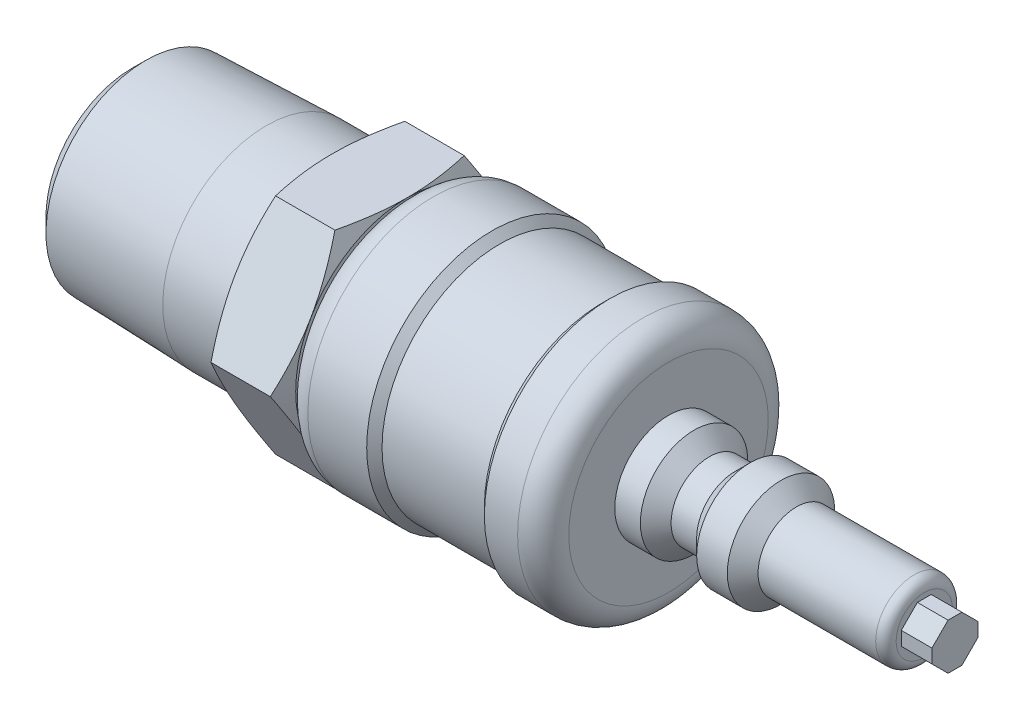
ISO-10303-21;
HEADER;
FILE_DESCRIPTION(('STEP AP214'),'2;1');
FILE_NAME('part.step','',(''),(''),'','','');
FILE_SCHEMA(('AUTOMOTIVE_DESIGN { 1 0 10303 214 1 1 1 1 }'));
ENDSEC;
DATA;
#1=APPLICATION_CONTEXT('core data for automotive mechanical design processes');
#2=APPLICATION_PROTOCOL_DEFINITION('international standard','automotive_design',2000,#1);
#3=PRODUCT_CONTEXT('',#1,'mechanical');
#4=PRODUCT('Part','Part','',(#3));
#5=PRODUCT_RELATED_PRODUCT_CATEGORY('part','',(#4));
#6=PRODUCT_DEFINITION_FORMATION('','',#4);
#7=PRODUCT_DEFINITION_CONTEXT('part definition',#1,'design');
#8=PRODUCT_DEFINITION('design','',#6,#7);
#9=PRODUCT_DEFINITION_SHAPE('','',#8);
#10=(LENGTH_UNIT() NAMED_UNIT(*) SI_UNIT(.MILLI.,.METRE.));
#11=(NAMED_UNIT(*) PLANE_ANGLE_UNIT() SI_UNIT($,.RADIAN.));
#12=(NAMED_UNIT(*) SI_UNIT($,.STERADIAN.) SOLID_ANGLE_UNIT());
#13=UNCERTAINTY_MEASURE_WITH_UNIT(LENGTH_MEASURE(1.E-05),#10,'distance_accuracy_value','');
#14=(GEOMETRIC_REPRESENTATION_CONTEXT(3) GLOBAL_UNCERTAINTY_ASSIGNED_CONTEXT((#13)) GLOBAL_UNIT_ASSIGNED_CONTEXT((#10,
#11,#12)) REPRESENTATION_CONTEXT('',''));
#15=CARTESIAN_POINT('',(0.,0.,0.));
#16=DIRECTION('',(0.,0.,1.));
#17=DIRECTION('',(1.,0.,0.));
#18=AXIS2_PLACEMENT_3D('',#15,#16,#17);
#19=CARTESIAN_POINT('',(39.37,1.143,0.3429));
#20=DIRECTION('',(0.,1.,0.));
#21=DIRECTION('',(0.,0.,1.));
#22=AXIS2_PLACEMENT_3D('',#19,#20,#21);
#23=PLANE('',#22);
#24=DIRECTION('',(0.,0.,1.));
#25=VECTOR('',#24,1.);
#26=CARTESIAN_POINT('',(39.37,1.143,0.3429));
#27=LINE('',#26,#25);
#28=CARTESIAN_POINT('',(39.37,1.143,-0.3429));
#29=VERTEX_POINT('',#28);
#30=CARTESIAN_POINT('',(39.37,1.143,0.3429));
#31=VERTEX_POINT('',#30);
#32=EDGE_CURVE('E517',#29,#31,#27,.T.);
#33=ORIENTED_EDGE('',*,*,#32,.T.);
#34=DIRECTION('',(1.,0.,0.));
#35=VECTOR('',#34,1.);
#36=CARTESIAN_POINT('',(39.37,1.143,0.3429));
#37=LINE('',#36,#35);
#38=CARTESIAN_POINT('',(40.894,1.143,0.3429));
#39=VERTEX_POINT('',#38);
#40=EDGE_CURVE('E501',#39,#31,#37,.F.);
#41=ORIENTED_EDGE('',*,*,#40,.F.);
#42=DIRECTION('',(0.,0.,1.));
#43=VECTOR('',#42,1.);
#44=CARTESIAN_POINT('',(40.894,1.143,-0.285749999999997));
#45=LINE('',#44,#43);
#46=CARTESIAN_POINT('',(40.894,1.143,-0.3429));
#47=VERTEX_POINT('',#46);
#48=EDGE_CURVE('E507',#47,#39,#45,.T.);
#49=ORIENTED_EDGE('',*,*,#48,.F.);
#50=DIRECTION('',(1.,0.,0.));
#51=VECTOR('',#50,1.);
#52=CARTESIAN_POINT('',(39.37,1.143,-0.3429));
#53=LINE('',#52,#51);
#54=EDGE_CURVE('E492',#29,#47,#53,.T.);
#55=ORIENTED_EDGE('',*,*,#54,.F.);
#56=EDGE_LOOP('',(#33,#41,#49,#55));
#57=FACE_BOUND('',#56,.T.);
#58=ADVANCED_FACE('F16',(#57),#23,.T.);
#59=CARTESIAN_POINT('',(39.37,0.3429,-1.143));
#60=DIRECTION('',(0.,0.,-1.));
#61=DIRECTION('',(-1.,0.,0.));
#62=AXIS2_PLACEMENT_3D('',#59,#60,#61);
#63=PLANE('',#62);
#64=DIRECTION('',(0.,1.,0.));
#65=VECTOR('',#64,1.);
#66=CARTESIAN_POINT('',(39.37,0.3429,-1.143));
#67=LINE('',#66,#65);
#68=CARTESIAN_POINT('',(39.37,-0.3429,-1.143));
#69=VERTEX_POINT('',#68);
#70=CARTESIAN_POINT('',(39.37,0.3429,-1.143));
#71=VERTEX_POINT('',#70);
#72=EDGE_CURVE('E515',#69,#71,#67,.T.);
#73=ORIENTED_EDGE('',*,*,#72,.T.);
#74=DIRECTION('',(1.,0.,0.));
#75=VECTOR('',#74,1.);
#76=CARTESIAN_POINT('',(39.37,0.3429,-1.143));
#77=LINE('',#76,#75);
#78=CARTESIAN_POINT('',(40.894,0.3429,-1.143));
#79=VERTEX_POINT('',#78);
#80=EDGE_CURVE('E495',#79,#71,#77,.F.);
#81=ORIENTED_EDGE('',*,*,#80,.F.);
#82=DIRECTION('',(0.,1.,0.));
#83=VECTOR('',#82,1.);
#84=CARTESIAN_POINT('',(40.894,0.,-1.143));
#85=LINE('',#84,#83);
#86=CARTESIAN_POINT('',(40.894,-0.3429,-1.143));
#87=VERTEX_POINT('',#86);
#88=EDGE_CURVE('E509',#87,#79,#85,.T.);
#89=ORIENTED_EDGE('',*,*,#88,.F.);
#90=DIRECTION('',(1.,0.,0.));
#91=VECTOR('',#90,1.);
#92=CARTESIAN_POINT('',(39.37,-0.3429,-1.143));
#93=LINE('',#92,#91);
#94=EDGE_CURVE('E483',#69,#87,#93,.T.);
#95=ORIENTED_EDGE('',*,*,#94,.F.);
#96=EDGE_LOOP('',(#73,#81,#89,#95));
#97=FACE_BOUND('',#96,.T.);
#98=ADVANCED_FACE('F1061',(#97),#63,.T.);
#99=CARTESIAN_POINT('',(39.37,-1.143,-0.3429));
#100=DIRECTION('',(0.,-1.,0.));
#101=DIRECTION('',(0.,0.,-1.));
#102=AXIS2_PLACEMENT_3D('',#99,#100,#101);
#103=PLANE('',#102);
#104=DIRECTION('',(0.,0.,-1.));
#105=VECTOR('',#104,1.);
#106=CARTESIAN_POINT('',(39.37,-1.143,-0.3429));
#107=LINE('',#106,#105);
#108=CARTESIAN_POINT('',(39.37,-1.143,0.3429));
#109=VERTEX_POINT('',#108);
#110=CARTESIAN_POINT('',(39.37,-1.143,-0.3429));
#111=VERTEX_POINT('',#110);
#112=EDGE_CURVE('E513',#109,#111,#107,.T.);
#113=ORIENTED_EDGE('',*,*,#112,.T.);
#114=DIRECTION('',(1.,0.,0.));
#115=VECTOR('',#114,1.);
#116=CARTESIAN_POINT('',(39.37,-1.143,-0.3429));
#117=LINE('',#116,#115);
#118=CARTESIAN_POINT('',(40.894,-1.143,-0.3429));
#119=VERTEX_POINT('',#118);
#120=EDGE_CURVE('E486',#119,#111,#117,.F.);
#121=ORIENTED_EDGE('',*,*,#120,.F.);
#122=DIRECTION('',(0.,0.,1.));
#123=VECTOR('',#122,1.);
#124=CARTESIAN_POINT('',(40.894,-1.143,-0.285749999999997));
#125=LINE('',#124,#123);
#126=CARTESIAN_POINT('',(40.894,-1.143,0.3429));
#127=VERTEX_POINT('',#126);
#128=EDGE_CURVE('E511',#127,#119,#125,.F.);
#129=ORIENTED_EDGE('',*,*,#128,.F.);
#130=DIRECTION('',(1.,0.,0.));
#131=VECTOR('',#130,1.);
#132=CARTESIAN_POINT('',(39.37,-1.143,0.3429));
#133=LINE('',#132,#131);
#134=EDGE_CURVE('E478',#109,#127,#133,.T.);
#135=ORIENTED_EDGE('',*,*,#134,.F.);
#136=EDGE_LOOP('',(#113,#121,#129,#135));
#137=FACE_BOUND('',#136,.T.);
#138=ADVANCED_FACE('F1052',(#137),#103,.T.);
#139=CARTESIAN_POINT('',(40.894,0.,-0.285749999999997));
#140=DIRECTION('',(1.,0.,0.));
#141=DIRECTION('',(0.,1.,0.));
#142=AXIS2_PLACEMENT_3D('',#139,#140,#141);
#143=PLANE('',#142);
#144=DIRECTION('',(0.,0.707106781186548,0.707106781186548));
#145=VECTOR('',#144,1.);
#146=CARTESIAN_POINT('',(40.894,1.143,-0.3429));
#147=LINE('',#146,#145);
#148=EDGE_CURVE('E498',#47,#79,#147,.F.);
#149=ORIENTED_EDGE('',*,*,#148,.F.);
#150=ORIENTED_EDGE('',*,*,#48,.T.);
#151=DIRECTION('',(0.,-0.707106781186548,0.707106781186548));
#152=VECTOR('',#151,1.);
#153=CARTESIAN_POINT('',(40.894,0.3429,1.143));
#154=LINE('',#153,#152);
#155=CARTESIAN_POINT('',(40.894,0.3429,1.143));
#156=VERTEX_POINT('',#155);
#157=EDGE_CURVE('E504',#156,#39,#154,.F.);
#158=ORIENTED_EDGE('',*,*,#157,.F.);
#159=DIRECTION('',(0.,1.,0.));
#160=VECTOR('',#159,1.);
#161=CARTESIAN_POINT('',(40.894,0.,1.143));
#162=LINE('',#161,#160);
#163=CARTESIAN_POINT('',(40.894,-0.3429,1.143));
#164=VERTEX_POINT('',#163);
#165=EDGE_CURVE('E476',#164,#156,#162,.T.);
#166=ORIENTED_EDGE('',*,*,#165,.F.);
#167=DIRECTION('',(0.,-0.707106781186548,-0.707106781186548));
#168=VECTOR('',#167,1.);
#169=CARTESIAN_POINT('',(40.894,-1.143,0.3429));
#170=LINE('',#169,#168);
#171=EDGE_CURVE('E481',#127,#164,#170,.F.);
#172=ORIENTED_EDGE('',*,*,#171,.F.);
#173=ORIENTED_EDGE('',*,*,#128,.T.);
#174=DIRECTION('',(0.,0.707106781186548,-0.707106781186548));
#175=VECTOR('',#174,1.);
#176=CARTESIAN_POINT('',(40.894,-0.3429,-1.143));
#177=LINE('',#176,#175);
#178=EDGE_CURVE('E489',#87,#119,#177,.F.);
#179=ORIENTED_EDGE('',*,*,#178,.F.);
#180=ORIENTED_EDGE('',*,*,#88,.T.);
#181=EDGE_LOOP('',(#149,#150,#158,#166,#172,#173,#179,#180));
#182=FACE_BOUND('',#181,.T.);
#183=ADVANCED_FACE('F1043',(#182),#143,.T.);
#184=CARTESIAN_POINT('',(39.37,0.3429,1.143));
#185=DIRECTION('',(0.,0.707106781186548,0.707106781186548));
#186=DIRECTION('',(0.,-0.707106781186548,0.707106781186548));
#187=AXIS2_PLACEMENT_3D('',#184,#185,#186);
#188=PLANE('',#187);
#189=DIRECTION('',(0.,0.707106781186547,-0.707106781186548));
#190=VECTOR('',#189,1.);
#191=CARTESIAN_POINT('',(39.37,0.3429,1.143));
#192=LINE('',#191,#190);
#193=CARTESIAN_POINT('',(39.37,0.3429,1.143));
#194=VERTEX_POINT('',#193);
#195=EDGE_CURVE('E473',#194,#31,#192,.T.);
#196=ORIENTED_EDGE('',*,*,#195,.F.);
#197=DIRECTION('',(1.,0.,0.));
#198=VECTOR('',#197,1.);
#199=CARTESIAN_POINT('',(39.37,0.3429,1.143));
#200=LINE('',#199,#198);
#201=EDGE_CURVE('E474',#156,#194,#200,.F.);
#202=ORIENTED_EDGE('',*,*,#201,.F.);
#203=ORIENTED_EDGE('',*,*,#157,.T.);
#204=ORIENTED_EDGE('',*,*,#40,.T.);
#205=EDGE_LOOP('',(#196,#202,#203,#204));
#206=FACE_BOUND('',#205,.T.);
#207=ADVANCED_FACE('F1034',(#206),#188,.T.);
#208=CARTESIAN_POINT('',(39.37,1.143,-0.3429));
#209=DIRECTION('',(0.,0.707106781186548,-0.707106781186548));
#210=DIRECTION('',(0.,0.707106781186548,0.707106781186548));
#211=AXIS2_PLACEMENT_3D('',#208,#209,#210);
#212=PLANE('',#211);
#213=DIRECTION('',(0.,-0.707106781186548,-0.707106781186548));
#214=VECTOR('',#213,1.);
#215=CARTESIAN_POINT('',(39.37,1.143,-0.3429));
#216=LINE('',#215,#214);
#217=EDGE_CURVE('E1140',#29,#71,#216,.T.);
#218=ORIENTED_EDGE('',*,*,#217,.F.);
#219=ORIENTED_EDGE('',*,*,#54,.T.);
#220=ORIENTED_EDGE('',*,*,#148,.T.);
#221=ORIENTED_EDGE('',*,*,#80,.T.);
#222=EDGE_LOOP('',(#218,#219,#220,#221));
#223=FACE_BOUND('',#222,.T.);
#224=ADVANCED_FACE('F1025',(#223),#212,.T.);
#225=CARTESIAN_POINT('',(39.37,-0.3429,-1.143));
#226=DIRECTION('',(0.,-0.707106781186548,-0.707106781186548));
#227=DIRECTION('',(0.,0.707106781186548,-0.707106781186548));
#228=AXIS2_PLACEMENT_3D('',#225,#226,#227);
#229=PLANE('',#228);
#230=DIRECTION('',(0.,-0.707106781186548,0.707106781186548));
#231=VECTOR('',#230,1.);
#232=CARTESIAN_POINT('',(39.37,-0.3429,-1.143));
#233=LINE('',#232,#231);
#234=EDGE_CURVE('E1141',#69,#111,#233,.T.);
#235=ORIENTED_EDGE('',*,*,#234,.F.);
#236=ORIENTED_EDGE('',*,*,#94,.T.);
#237=ORIENTED_EDGE('',*,*,#178,.T.);
#238=ORIENTED_EDGE('',*,*,#120,.T.);
#239=EDGE_LOOP('',(#235,#236,#237,#238));
#240=FACE_BOUND('',#239,.T.);
#241=ADVANCED_FACE('F1016',(#240),#229,.T.);
#242=CARTESIAN_POINT('',(39.37,-1.143,0.3429));
#243=DIRECTION('',(0.,-0.707106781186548,0.707106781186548));
#244=DIRECTION('',(0.,-0.707106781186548,-0.707106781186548));
#245=AXIS2_PLACEMENT_3D('',#242,#243,#244);
#246=PLANE('',#245);
#247=DIRECTION('',(0.,0.707106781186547,0.707106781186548));
#248=VECTOR('',#247,1.);
#249=CARTESIAN_POINT('',(39.37,-1.143,0.3429));
#250=LINE('',#249,#248);
#251=CARTESIAN_POINT('',(39.37,-0.3429,1.143));
#252=VERTEX_POINT('',#251);
#253=EDGE_CURVE('E113',#109,#252,#250,.T.);
#254=ORIENTED_EDGE('',*,*,#253,.F.);
#255=ORIENTED_EDGE('',*,*,#134,.T.);
#256=ORIENTED_EDGE('',*,*,#171,.T.);
#257=DIRECTION('',(1.,0.,0.));
#258=VECTOR('',#257,1.);
#259=CARTESIAN_POINT('',(39.37,-0.3429,1.143));
#260=LINE('',#259,#258);
#261=EDGE_CURVE('E465',#252,#164,#260,.T.);
#262=ORIENTED_EDGE('',*,*,#261,.F.);
#263=EDGE_LOOP('',(#254,#255,#256,#262));
#264=FACE_BOUND('',#263,.T.);
#265=ADVANCED_FACE('F1008',(#264),#246,.T.);
#266=CARTESIAN_POINT('',(39.37,0.,1.143));
#267=DIRECTION('',(0.,0.,1.));
#268=DIRECTION('',(1.,0.,0.));
#269=AXIS2_PLACEMENT_3D('',#266,#267,#268);
#270=PLANE('',#269);
#271=DIRECTION('',(0.,1.,0.));
#272=VECTOR('',#271,1.);
#273=CARTESIAN_POINT('',(39.37,0.,1.143));
#274=LINE('',#273,#272);
#275=EDGE_CURVE('E1139',#252,#194,#274,.T.);
#276=ORIENTED_EDGE('',*,*,#275,.F.);
#277=ORIENTED_EDGE('',*,*,#261,.T.);
#278=ORIENTED_EDGE('',*,*,#165,.T.);
#279=ORIENTED_EDGE('',*,*,#201,.T.);
#280=EDGE_LOOP('',(#276,#277,#278,#279));
#281=FACE_BOUND('',#280,.T.);
#282=ADVANCED_FACE('F1000',(#281),#270,.T.);
#283=CARTESIAN_POINT('',(39.37,0.,-0.984249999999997));
#284=DIRECTION('',(1.,0.,0.));
#285=DIRECTION('',(0.,1.,0.));
#286=AXIS2_PLACEMENT_3D('',#283,#284,#285);
#287=PLANE('',#286);
#288=CARTESIAN_POINT('',(39.37,0.,0.));
#289=DIRECTION('',(-1.,0.,0.));
#290=DIRECTION('',(0.,0.,-1.));
#291=AXIS2_PLACEMENT_3D('',#288,#289,#290);
#292=CIRCLE('',#291,1.397);
#293=CARTESIAN_POINT('',(39.37,0.,-1.397));
#294=VERTEX_POINT('',#293);
#295=EDGE_CURVE('E1148',#294,#294,#292,.T.);
#296=ORIENTED_EDGE('',*,*,#295,.F.);
#297=EDGE_LOOP('',(#296));
#298=FACE_BOUND('',#297,.T.);
#299=ORIENTED_EDGE('',*,*,#253,.T.);
#300=ORIENTED_EDGE('',*,*,#275,.T.);
#301=ORIENTED_EDGE('',*,*,#195,.T.);
#302=ORIENTED_EDGE('',*,*,#32,.F.);
#303=ORIENTED_EDGE('',*,*,#217,.T.);
#304=ORIENTED_EDGE('',*,*,#72,.F.);
#305=ORIENTED_EDGE('',*,*,#234,.T.);
#306=ORIENTED_EDGE('',*,*,#112,.F.);
#307=EDGE_LOOP('',(#299,#300,#301,#302,#303,#304,#305,#306));
#308=FACE_BOUND('',#307,.T.);
#309=ADVANCED_FACE('F453',(#298,#308),#287,.T.);
#310=CARTESIAN_POINT('',(38.862,0.,0.));
#311=DIRECTION('',(-1.,0.,0.));
#312=DIRECTION('',(0.,0.,1.));
#313=AXIS2_PLACEMENT_3D('',#310,#311,#312);
#314=TOROIDAL_SURFACE('',#313,1.397,0.507999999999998);
#315=ORIENTED_EDGE('',*,*,#295,.T.);
#316=EDGE_LOOP('',(#315));
#317=FACE_BOUND('',#316,.T.);
#318=CARTESIAN_POINT('',(38.862,0.,0.));
#319=DIRECTION('',(-1.,0.,0.));
#320=DIRECTION('',(0.,0.,1.));
#321=AXIS2_PLACEMENT_3D('',#318,#319,#320);
#322=CIRCLE('',#321,1.905);
#323=CARTESIAN_POINT('',(38.862,0.,1.905));
#324=VERTEX_POINT('',#323);
#325=EDGE_CURVE('E442',#324,#324,#322,.T.);
#326=ORIENTED_EDGE('',*,*,#325,.F.);
#327=EDGE_LOOP('',(#326));
#328=FACE_BOUND('',#327,.T.);
#329=ADVANCED_FACE('F447',(#317,#328),#314,.T.);
#330=CARTESIAN_POINT('',(35.941,0.,0.));
#331=DIRECTION('',(-1.,0.,0.));
#332=DIRECTION('',(0.,0.,1.));
#333=AXIS2_PLACEMENT_3D('',#330,#331,#332);
#334=CYLINDRICAL_SURFACE('',#333,1.905);
#335=CARTESIAN_POINT('',(33.0200000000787,0.,0.));
#336=DIRECTION('',(-1.,0.,0.));
#337=DIRECTION('',(0.,0.,-1.));
#338=AXIS2_PLACEMENT_3D('',#335,#336,#337);
#339=CIRCLE('',#338,1.90500000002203);
#340=CARTESIAN_POINT('',(33.0200000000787,0.,-1.90500000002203));
#341=VERTEX_POINT('',#340);
#342=EDGE_CURVE('E439',#341,#341,#339,.T.);
#343=ORIENTED_EDGE('',*,*,#342,.F.);
#344=EDGE_LOOP('',(#343));
#345=FACE_BOUND('',#344,.T.);
#346=ORIENTED_EDGE('',*,*,#325,.T.);
#347=EDGE_LOOP('',(#346));
#348=FACE_BOUND('',#347,.T.);
#349=ADVANCED_FACE('F452',(#345,#348),#334,.T.);
#350=CARTESIAN_POINT('',(32.2580000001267,0.,0.));
#351=DIRECTION('',(-1.,0.,0.));
#352=DIRECTION('',(0.,0.,1.));
#353=AXIS2_PLACEMENT_3D('',#350,#351,#352);
#354=CONICAL_SURFACE('',#353,2.666999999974,0.785398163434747);
#355=CARTESIAN_POINT('',(32.258,0.,0.));
#356=DIRECTION('',(-1.,0.,0.));
#357=DIRECTION('',(0.,0.,1.));
#358=AXIS2_PLACEMENT_3D('',#355,#356,#357);
#359=CIRCLE('',#358,2.667);
#360=CARTESIAN_POINT('',(32.258,0.,2.667));
#361=VERTEX_POINT('',#360);
#362=EDGE_CURVE('E436',#361,#361,#359,.T.);
#363=ORIENTED_EDGE('',*,*,#362,.F.);
#364=EDGE_LOOP('',(#363));
#365=FACE_BOUND('',#364,.T.);
#366=ORIENTED_EDGE('',*,*,#342,.T.);
#367=EDGE_LOOP('',(#366));
#368=FACE_BOUND('',#367,.T.);
#369=ADVANCED_FACE('F972',(#365,#368),#354,.T.);
#370=CARTESIAN_POINT('',(31.496,0.,0.));
#371=DIRECTION('',(-1.,0.,0.));
#372=DIRECTION('',(0.,0.,1.));
#373=AXIS2_PLACEMENT_3D('',#370,#371,#372);
#374=CYLINDRICAL_SURFACE('',#373,2.667);
#375=CARTESIAN_POINT('',(30.7339999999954,0.,0.));
#376=DIRECTION('',(1.,0.,0.));
#377=DIRECTION('',(0.,0.,-1.));
#378=AXIS2_PLACEMENT_3D('',#375,#376,#377);
#379=CIRCLE('',#378,2.66700000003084);
#380=CARTESIAN_POINT('',(30.7339999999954,0.,-2.66700000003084));
#381=VERTEX_POINT('',#380);
#382=EDGE_CURVE('E433',#381,#381,#379,.F.);
#383=ORIENTED_EDGE('',*,*,#382,.F.);
#384=EDGE_LOOP('',(#383));
#385=FACE_BOUND('',#384,.T.);
#386=ORIENTED_EDGE('',*,*,#362,.T.);
#387=EDGE_LOOP('',(#386));
#388=FACE_BOUND('',#387,.T.);
#389=ADVANCED_FACE('F963',(#385,#388),#374,.T.);
#390=CARTESIAN_POINT('',(30.7340000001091,0.,0.));
#391=DIRECTION('',(1.,0.,0.));
#392=DIRECTION('',(0.,0.,-1.));
#393=AXIS2_PLACEMENT_3D('',#390,#391,#392);
#394=CONICAL_SURFACE('',#393,2.66700000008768,0.785398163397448);
#395=CARTESIAN_POINT('',(29.972,0.,0.));
#396=DIRECTION('',(-1.,0.,0.));
#397=DIRECTION('',(0.,0.,1.));
#398=AXIS2_PLACEMENT_3D('',#395,#396,#397);
#399=CIRCLE('',#398,1.905);
#400=CARTESIAN_POINT('',(29.972,0.,1.905));
#401=VERTEX_POINT('',#400);
#402=EDGE_CURVE('E430',#401,#401,#399,.T.);
#403=ORIENTED_EDGE('',*,*,#402,.F.);
#404=EDGE_LOOP('',(#403));
#405=FACE_BOUND('',#404,.T.);
#406=ORIENTED_EDGE('',*,*,#382,.T.);
#407=EDGE_LOOP('',(#406));
#408=FACE_BOUND('',#407,.T.);
#409=ADVANCED_FACE('F954',(#405,#408),#394,.T.);
#410=CARTESIAN_POINT('',(29.337,0.,0.));
#411=DIRECTION('',(-1.,0.,0.));
#412=DIRECTION('',(0.,0.,1.));
#413=AXIS2_PLACEMENT_3D('',#410,#411,#412);
#414=CYLINDRICAL_SURFACE('',#413,1.905);
#415=CARTESIAN_POINT('',(28.7020000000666,0.,0.));
#416=DIRECTION('',(-1.,0.,0.));
#417=DIRECTION('',(0.,0.,-1.));
#418=AXIS2_PLACEMENT_3D('',#415,#416,#417);
#419=CIRCLE('',#418,1.90500000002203);
#420=CARTESIAN_POINT('',(28.7020000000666,0.,-1.90500000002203));
#421=VERTEX_POINT('',#420);
#422=EDGE_CURVE('E427',#421,#421,#419,.T.);
#423=ORIENTED_EDGE('',*,*,#422,.F.);
#424=EDGE_LOOP('',(#423));
#425=FACE_BOUND('',#424,.T.);
#426=ORIENTED_EDGE('',*,*,#402,.T.);
#427=EDGE_LOOP('',(#426));
#428=FACE_BOUND('',#427,.T.);
#429=ADVANCED_FACE('F945',(#425,#428),#414,.T.);
#430=CARTESIAN_POINT('',(27.9400000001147,0.,0.));
#431=DIRECTION('',(-1.,0.,0.));
#432=DIRECTION('',(0.,-1.,0.));
#433=AXIS2_PLACEMENT_3D('',#430,#431,#432);
#434=CONICAL_SURFACE('',#433,2.666999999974,0.785398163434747);
#435=CARTESIAN_POINT('',(27.94,0.,0.));
#436=DIRECTION('',(-1.,0.,0.));
#437=DIRECTION('',(0.,0.,1.));
#438=AXIS2_PLACEMENT_3D('',#435,#436,#437);
#439=CIRCLE('',#438,2.667);
#440=CARTESIAN_POINT('',(27.94,0.,2.667));
#441=VERTEX_POINT('',#440);
#442=EDGE_CURVE('E419',#441,#441,#439,.T.);
#443=ORIENTED_EDGE('',*,*,#442,.F.);
#444=EDGE_LOOP('',(#443));
#445=FACE_BOUND('',#444,.T.);
#446=ORIENTED_EDGE('',*,*,#422,.T.);
#447=EDGE_LOOP('',(#446));
#448=FACE_BOUND('',#447,.T.);
#449=ADVANCED_FACE('F937',(#445,#448),#434,.T.);
#450=CARTESIAN_POINT('',(27.305,0.,0.));
#451=DIRECTION('',(-1.,0.,0.));
#452=DIRECTION('',(0.,0.,1.));
#453=AXIS2_PLACEMENT_3D('',#450,#451,#452);
#454=CYLINDRICAL_SURFACE('',#453,2.667);
#455=CARTESIAN_POINT('',(26.67,0.,0.));
#456=DIRECTION('',(-1.,0.,0.));
#457=DIRECTION('',(0.,0.,1.));
#458=AXIS2_PLACEMENT_3D('',#455,#456,#457);
#459=CIRCLE('',#458,2.667);
#460=CARTESIAN_POINT('',(26.67,0.,2.667));
#461=VERTEX_POINT('',#460);
#462=EDGE_CURVE('E19',#461,#461,#459,.T.);
#463=ORIENTED_EDGE('',*,*,#462,.F.);
#464=EDGE_LOOP('',(#463));
#465=FACE_BOUND('',#464,.T.);
#466=ORIENTED_EDGE('',*,*,#442,.T.);
#467=EDGE_LOOP('',(#466));
#468=FACE_BOUND('',#467,.T.);
#469=ADVANCED_FACE('F929',(#465,#468),#454,.T.);
#470=CARTESIAN_POINT('',(26.67,0.,-3.81));
#471=DIRECTION('',(1.,0.,0.));
#472=DIRECTION('',(0.,1.,0.));
#473=AXIS2_PLACEMENT_3D('',#470,#471,#472);
#474=PLANE('',#473);
#475=ORIENTED_EDGE('',*,*,#462,.T.);
#476=EDGE_LOOP('',(#475));
#477=FACE_BOUND('',#476,.T.);
#478=CARTESIAN_POINT('',(26.67,0.,0.));
#479=DIRECTION('',(-1.,0.,0.));
#480=DIRECTION('',(0.,0.,-1.));
#481=AXIS2_PLACEMENT_3D('',#478,#479,#480);
#482=CIRCLE('',#481,4.953);
#483=CARTESIAN_POINT('',(26.67,0.,-4.953));
#484=VERTEX_POINT('',#483);
#485=EDGE_CURVE('E396',#484,#484,#482,.T.);
#486=ORIENTED_EDGE('',*,*,#485,.F.);
#487=EDGE_LOOP('',(#486));
#488=FACE_BOUND('',#487,.T.);
#489=ADVANCED_FACE('F408',(#477,#488),#474,.T.);
#490=CARTESIAN_POINT('',(25.4,0.,0.));
#491=DIRECTION('',(-1.,0.,0.));
#492=DIRECTION('',(0.,0.,1.));
#493=AXIS2_PLACEMENT_3D('',#490,#491,#492);
#494=TOROIDAL_SURFACE('',#493,4.953,1.27);
#495=ORIENTED_EDGE('',*,*,#485,.T.);
#496=EDGE_LOOP('',(#495));
#497=FACE_BOUND('',#496,.T.);
#498=CARTESIAN_POINT('',(25.4,0.,0.));
#499=DIRECTION('',(-1.,0.,0.));
#500=DIRECTION('',(0.,0.,1.));
#501=AXIS2_PLACEMENT_3D('',#498,#499,#500);
#502=CIRCLE('',#501,6.223);
#503=CARTESIAN_POINT('',(25.4,0.,6.223));
#504=VERTEX_POINT('',#503);
#505=EDGE_CURVE('E393',#504,#504,#502,.T.);
#506=ORIENTED_EDGE('',*,*,#505,.F.);
#507=EDGE_LOOP('',(#506));
#508=FACE_BOUND('',#507,.T.);
#509=ADVANCED_FACE('F402',(#497,#508),#494,.T.);
#510=CARTESIAN_POINT('',(24.5745,0.,0.));
#511=DIRECTION('',(-1.,0.,0.));
#512=DIRECTION('',(0.,0.,1.));
#513=AXIS2_PLACEMENT_3D('',#510,#511,#512);
#514=CYLINDRICAL_SURFACE('',#513,6.223);
#515=CARTESIAN_POINT('',(23.7489999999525,0.,0.));
#516=DIRECTION('',(1.,0.,0.));
#517=DIRECTION('',(0.,0.,-1.));
#518=AXIS2_PLACEMENT_3D('',#515,#516,#517);
#519=CIRCLE('',#518,6.22299999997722);
#520=CARTESIAN_POINT('',(23.7489999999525,0.,-6.22299999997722));
#521=VERTEX_POINT('',#520);
#522=EDGE_CURVE('E390',#521,#521,#519,.F.);
#523=ORIENTED_EDGE('',*,*,#522,.F.);
#524=EDGE_LOOP('',(#523));
#525=FACE_BOUND('',#524,.T.);
#526=ORIENTED_EDGE('',*,*,#505,.T.);
#527=EDGE_LOOP('',(#526));
#528=FACE_BOUND('',#527,.T.);
#529=ADVANCED_FACE('F407',(#525,#528),#514,.T.);
#530=CARTESIAN_POINT('',(23.7489999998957,0.,0.));
#531=DIRECTION('',(1.,0.,0.));
#532=DIRECTION('',(0.,0.,-1.));
#533=AXIS2_PLACEMENT_3D('',#530,#531,#532);
#534=CONICAL_SURFACE('',#533,6.22299999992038,0.785398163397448);
#535=CARTESIAN_POINT('',(23.368,0.,0.));
#536=DIRECTION('',(-1.,0.,0.));
#537=DIRECTION('',(0.,0.,1.));
#538=AXIS2_PLACEMENT_3D('',#535,#536,#537);
#539=CIRCLE('',#538,5.842);
#540=CARTESIAN_POINT('',(23.368,0.,5.842));
#541=VERTEX_POINT('',#540);
#542=EDGE_CURVE('E387',#541,#541,#539,.T.);
#543=ORIENTED_EDGE('',*,*,#542,.F.);
#544=EDGE_LOOP('',(#543));
#545=FACE_BOUND('',#544,.T.);
#546=ORIENTED_EDGE('',*,*,#522,.T.);
#547=EDGE_LOOP('',(#546));
#548=FACE_BOUND('',#547,.T.);
#549=ADVANCED_FACE('F687',(#545,#548),#534,.T.);
#550=CARTESIAN_POINT('',(20.828,0.,0.));
#551=DIRECTION('',(-1.,0.,0.));
#552=DIRECTION('',(0.,0.,1.));
#553=AXIS2_PLACEMENT_3D('',#550,#551,#552);
#554=CYLINDRICAL_SURFACE('',#553,5.842);
#555=CARTESIAN_POINT('',(18.2880000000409,0.,0.));
#556=DIRECTION('',(-1.,0.,0.));
#557=DIRECTION('',(0.,0.,-1.));
#558=AXIS2_PLACEMENT_3D('',#555,#556,#557);
#559=CIRCLE('',#558,5.84199999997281);
#560=CARTESIAN_POINT('',(18.2880000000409,0.,-5.84199999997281));
#561=VERTEX_POINT('',#560);
#562=EDGE_CURVE('E384',#561,#561,#559,.T.);
#563=ORIENTED_EDGE('',*,*,#562,.F.);
#564=EDGE_LOOP('',(#563));
#565=FACE_BOUND('',#564,.T.);
#566=ORIENTED_EDGE('',*,*,#542,.T.);
#567=EDGE_LOOP('',(#566));
#568=FACE_BOUND('',#567,.T.);
#569=ADVANCED_FACE('F682',(#565,#568),#554,.T.);
#570=CARTESIAN_POINT('',(17.9070000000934,0.,0.));
#571=DIRECTION('',(-1.,0.,0.));
#572=DIRECTION('',(0.,0.,1.));
#573=AXIS2_PLACEMENT_3D('',#570,#571,#572);
#574=CONICAL_SURFACE('',#573,6.22299999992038,0.785398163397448);
#575=CARTESIAN_POINT('',(17.907,0.,0.));
#576=DIRECTION('',(-1.,0.,0.));
#577=DIRECTION('',(0.,0.,1.));
#578=AXIS2_PLACEMENT_3D('',#575,#576,#577);
#579=CIRCLE('',#578,6.223);
#580=CARTESIAN_POINT('',(17.907,0.,6.223));
#581=VERTEX_POINT('',#580);
#582=EDGE_CURVE('E375',#581,#581,#579,.T.);
#583=ORIENTED_EDGE('',*,*,#582,.F.);
#584=EDGE_LOOP('',(#583));
#585=FACE_BOUND('',#584,.T.);
#586=ORIENTED_EDGE('',*,*,#562,.T.);
#587=EDGE_LOOP('',(#586));
#588=FACE_BOUND('',#587,.T.);
#589=ADVANCED_FACE('F677',(#585,#588),#574,.T.);
#590=CARTESIAN_POINT('',(16.4465,0.,0.));
#591=DIRECTION('',(-1.,0.,0.));
#592=DIRECTION('',(0.,0.,1.));
#593=AXIS2_PLACEMENT_3D('',#590,#591,#592);
#594=CYLINDRICAL_SURFACE('',#593,6.223);
#595=CARTESIAN_POINT('',(14.986,0.,0.));
#596=DIRECTION('',(-1.,0.,0.));
#597=DIRECTION('',(0.,0.,1.));
#598=AXIS2_PLACEMENT_3D('',#595,#596,#597);
#599=CIRCLE('',#598,6.223);
#600=CARTESIAN_POINT('',(14.986,0.,6.223));
#601=VERTEX_POINT('',#600);
#602=EDGE_CURVE('E383',#601,#601,#599,.T.);
#603=ORIENTED_EDGE('',*,*,#602,.F.);
#604=EDGE_LOOP('',(#603));
#605=FACE_BOUND('',#604,.T.);
#606=ORIENTED_EDGE('',*,*,#582,.T.);
#607=EDGE_LOOP('',(#606));
#608=FACE_BOUND('',#607,.T.);
#609=ADVANCED_FACE('F367',(#605,#608),#594,.T.);
#610=CARTESIAN_POINT('',(14.986,0.,0.));
#611=DIRECTION('',(-1.,0.,0.));
#612=DIRECTION('',(0.,0.,1.));
#613=AXIS2_PLACEMENT_3D('',#610,#611,#612);
#614=TOROIDAL_SURFACE('',#613,4.953,1.27);
#615=ORIENTED_EDGE('',*,*,#602,.T.);
#616=EDGE_LOOP('',(#615));
#617=FACE_BOUND('',#616,.T.);
#618=CARTESIAN_POINT('',(13.716,0.,0.));
#619=DIRECTION('',(1.,0.,0.));
#620=DIRECTION('',(0.,0.,-1.));
#621=AXIS2_PLACEMENT_3D('',#618,#619,#620);
#622=CIRCLE('',#621,4.953);
#623=CARTESIAN_POINT('',(13.716,0.,-4.953));
#624=VERTEX_POINT('',#623);
#625=EDGE_CURVE('E348',#624,#624,#622,.F.);
#626=ORIENTED_EDGE('',*,*,#625,.F.);
#627=EDGE_LOOP('',(#626));
#628=FACE_BOUND('',#627,.T.);
#629=ADVANCED_FACE('F363',(#617,#628),#614,.T.);
#630=CARTESIAN_POINT('',(13.716,0.,0.));
#631=DIRECTION('',(1.,0.,0.));
#632=DIRECTION('',(0.,1.,0.));
#633=AXIS2_PLACEMENT_3D('',#630,#631,#632);
#634=PLANE('',#633);
#635=ORIENTED_EDGE('',*,*,#625,.T.);
#636=EDGE_LOOP('',(#635));
#637=FACE_BOUND('',#636,.T.);
#638=CARTESIAN_POINT('',(13.7159999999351,0.,0.));
#639=DIRECTION('',(-1.,0.,0.));
#640=DIRECTION('',(0.,0.,1.));
#641=AXIS2_PLACEMENT_3D('',#638,#639,#640);
#642=CIRCLE('',#641,5.55625000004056);
#643=CARTESIAN_POINT('',(13.7159999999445,2.77812500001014,4.81185364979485));
#644=VERTEX_POINT('',#643);
#645=CARTESIAN_POINT('',(13.7159999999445,-2.77812500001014,4.81185364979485));
#646=VERTEX_POINT('',#645);
#647=EDGE_CURVE('E894',#644,#646,#642,.F.);
#648=ORIENTED_EDGE('',*,*,#647,.T.);
#649=CARTESIAN_POINT('',(13.7159999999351,0.,0.));
#650=DIRECTION('',(-1.,0.,0.));
#651=DIRECTION('',(0.,0.,1.));
#652=AXIS2_PLACEMENT_3D('',#649,#650,#651);
#653=CIRCLE('',#652,5.55625000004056);
#654=CARTESIAN_POINT('',(13.7159999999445,-5.55625000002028,0.));
#655=VERTEX_POINT('',#654);
#656=EDGE_CURVE('E663',#646,#655,#653,.F.);
#657=ORIENTED_EDGE('',*,*,#656,.T.);
#658=CARTESIAN_POINT('',(13.7159999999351,0.,0.));
#659=DIRECTION('',(-1.,0.,0.));
#660=DIRECTION('',(0.,0.,1.));
#661=AXIS2_PLACEMENT_3D('',#658,#659,#660);
#662=CIRCLE('',#661,5.55625000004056);
#663=CARTESIAN_POINT('',(13.7159999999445,-2.77812500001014,-4.81185364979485));
#664=VERTEX_POINT('',#663);
#665=EDGE_CURVE('E103',#655,#664,#662,.F.);
#666=ORIENTED_EDGE('',*,*,#665,.T.);
#667=CARTESIAN_POINT('',(13.7159999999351,0.,0.));
#668=DIRECTION('',(-1.,0.,0.));
#669=DIRECTION('',(0.,0.,1.));
#670=AXIS2_PLACEMENT_3D('',#667,#668,#669);
#671=CIRCLE('',#670,5.55625000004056);
#672=CARTESIAN_POINT('',(13.7159999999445,2.77812500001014,-4.81185364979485));
#673=VERTEX_POINT('',#672);
#674=EDGE_CURVE('E664',#664,#673,#671,.F.);
#675=ORIENTED_EDGE('',*,*,#674,.T.);
#676=CARTESIAN_POINT('',(13.7159999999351,0.,0.));
#677=DIRECTION('',(-1.,0.,0.));
#678=DIRECTION('',(0.,0.,1.));
#679=AXIS2_PLACEMENT_3D('',#676,#677,#678);
#680=CIRCLE('',#679,5.55625000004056);
#681=CARTESIAN_POINT('',(13.7159999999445,5.55625000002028,0.));
#682=VERTEX_POINT('',#681);
#683=EDGE_CURVE('E660',#673,#682,#680,.F.);
#684=ORIENTED_EDGE('',*,*,#683,.T.);
#685=CARTESIAN_POINT('',(13.7159999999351,0.,0.));
#686=DIRECTION('',(-1.,0.,0.));
#687=DIRECTION('',(0.,0.,1.));
#688=AXIS2_PLACEMENT_3D('',#685,#686,#687);
#689=CIRCLE('',#688,5.55625000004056);
#690=EDGE_CURVE('E667',#682,#644,#689,.F.);
#691=ORIENTED_EDGE('',*,*,#690,.T.);
#692=EDGE_LOOP('',(#648,#657,#666,#675,#684,#691));
#693=FACE_BOUND('',#692,.T.);
#694=ADVANCED_FACE('F354',(#637,#693),#634,.T.);
#695=CARTESIAN_POINT('',(13.7159999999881,0.,0.));
#696=DIRECTION('',(-1.,0.,0.));
#697=DIRECTION('',(0.,0.,1.));
#698=AXIS2_PLACEMENT_3D('',#695,#696,#697);
#699=CONICAL_SURFACE('',#698,5.55624999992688,1.13446401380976);
#700=ORIENTED_EDGE('',*,*,#665,.F.);
#701=CARTESIAN_POINT('',(13.3151829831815,-5.55625000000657,-3.20790243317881));
#702=CARTESIAN_POINT('',(13.376570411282,-5.5562500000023,-2.94470682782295));
#703=CARTESIAN_POINT('',(13.4325932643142,-5.5562500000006,-2.68009315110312));
#704=CARTESIAN_POINT('',(13.5312093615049,-5.5562499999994,-2.14931579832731));
#705=CARTESIAN_POINT('',(13.5738471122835,-5.55624999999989,-1.88316032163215));
#706=CARTESIAN_POINT('',(13.6260558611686,-5.55625000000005,-1.48228469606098));
#707=CARTESIAN_POINT('',(13.6415048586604,-5.55625000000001,-1.34832853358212));
#708=CARTESIAN_POINT('',(13.6682164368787,-5.55624999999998,-1.07999806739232));
#709=CARTESIAN_POINT('',(13.6794790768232,-5.55624999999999,-0.945623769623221));
#710=CARTESIAN_POINT('',(13.697629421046,-5.55625,-0.676127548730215));
#711=CARTESIAN_POINT('',(13.704502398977,-5.55625,-0.541004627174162));
#712=CARTESIAN_POINT('',(13.7136959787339,-5.55625,-0.270589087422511));
#713=CARTESIAN_POINT('',(13.7160160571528,-5.55624999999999,-0.135296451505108));
#714=CARTESIAN_POINT('',(13.715999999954,-5.55625,0.));
#715=B_SPLINE_CURVE_WITH_KNOTS('',3,(#701,#702,#703,#704,#705,#706,#707,#708,#709,#710,#711,
#712,#713,#714),.UNSPECIFIED.,.F.,.F.,(4,2,2,2,2,2,4),(0.,0.810983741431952,1.61924160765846,
2.02371411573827,2.42818090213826,2.83399755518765,3.2398608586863),.UNSPECIFIED.);
#716=CARTESIAN_POINT('',(13.3151829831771,-5.55624999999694,-3.20790243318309));
#717=VERTEX_POINT('',#716);
#718=EDGE_CURVE('E895',#717,#655,#715,.T.);
#719=ORIENTED_EDGE('',*,*,#718,.F.);
#720=CARTESIAN_POINT('',(13.715999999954,-2.778125,-4.81185364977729));
#721=CARTESIAN_POINT('',(13.7160160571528,-2.89529516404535,-4.74420542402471));
#722=CARTESIAN_POINT('',(13.7136959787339,-3.01246202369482,-4.67655910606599));
#723=CARTESIAN_POINT('',(13.704502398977,-3.24664875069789,-4.54135133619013));
#724=CARTESIAN_POINT('',(13.697629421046,-3.36366863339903,-4.47378987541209));
#725=CARTESIAN_POINT('',(13.6794790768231,-3.59705920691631,-4.33904176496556));
#726=CARTESIAN_POINT('',(13.6682164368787,-3.71343076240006,-4.27185461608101));
#727=CARTESIAN_POINT('',(13.6415048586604,-3.94581176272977,-4.1376893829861));
#728=CARTESIAN_POINT('',(13.6260558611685,-4.06182120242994,-4.07071130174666));
#729=CARTESIAN_POINT('',(13.5738471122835,-4.40898967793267,-3.87027348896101));
#730=CARTESIAN_POINT('',(13.5312093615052,-4.63948708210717,-3.73719575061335));
#731=CARTESIAN_POINT('',(13.4325932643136,-5.09915375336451,-3.47180707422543));
#732=CARTESIAN_POINT('',(13.3765704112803,-5.32831591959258,-3.33950023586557));
#733=CARTESIAN_POINT('',(13.3151829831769,-5.55624999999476,-3.20790243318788));
#734=B_SPLINE_CURVE_WITH_KNOTS('',3,(#720,#721,#722,#723,#724,#725,#726,#727,#728,#729,#730,
#731,#732,#733),.UNSPECIFIED.,.F.,.F.,(4,2,2,2,2,2,4),(0.,0.405863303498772,0.811679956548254,
1.21614674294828,1.62061925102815,2.42887711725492,3.23986085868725),.UNSPECIFIED.);
#735=EDGE_CURVE('E286',#664,#717,#734,.T.);
#736=ORIENTED_EDGE('',*,*,#735,.F.);
#737=EDGE_LOOP('',(#700,#719,#736));
#738=FACE_BOUND('',#737,.T.);
#739=ADVANCED_FACE('F312',(#738),#699,.T.);
#740=CARTESIAN_POINT('',(13.7159999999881,0.,0.));
#741=DIRECTION('',(-1.,0.,0.));
#742=DIRECTION('',(0.,0.,1.));
#743=AXIS2_PLACEMENT_3D('',#740,#741,#742);
#744=CONICAL_SURFACE('',#743,5.55624999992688,1.13446401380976);
#745=ORIENTED_EDGE('',*,*,#674,.F.);
#746=CARTESIAN_POINT('',(13.3151829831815,-8.52690864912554E-12,-6.41580486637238));
#747=CARTESIAN_POINT('',(13.376570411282,-0.227934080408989,-6.28420706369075));
#748=CARTESIAN_POINT('',(13.4325932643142,-0.457096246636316,-6.15190022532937));
#749=CARTESIAN_POINT('',(13.5312093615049,-0.916762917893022,-5.88651154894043));
#750=CARTESIAN_POINT('',(13.5738471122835,-1.14726032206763,-5.75343381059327));
#751=CARTESIAN_POINT('',(13.6260558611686,-1.49442879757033,-5.55299599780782));
#752=CARTESIAN_POINT('',(13.6415048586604,-1.61043823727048,-5.48601791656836));
#753=CARTESIAN_POINT('',(13.6682164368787,-1.84281923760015,-5.35185268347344));
#754=CARTESIAN_POINT('',(13.6794790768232,-1.95919079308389,-5.28466553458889));
#755=CARTESIAN_POINT('',(13.697629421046,-2.19258136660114,-5.1499174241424));
#756=CARTESIAN_POINT('',(13.704502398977,-2.30960124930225,-5.08235596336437));
#757=CARTESIAN_POINT('',(13.7136959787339,-2.54378797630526,-4.94714819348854));
#758=CARTESIAN_POINT('',(13.7160160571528,-2.66095483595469,-4.87950187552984));
#759=CARTESIAN_POINT('',(13.715999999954,-2.778125,-4.81185364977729));
#760=B_SPLINE_CURVE_WITH_KNOTS('',3,(#746,#747,#748,#749,#750,#751,#752,#753,#754,#755,#756,
#757,#758,#759),.UNSPECIFIED.,.F.,.F.,(4,2,2,2,2,2,4),(0.,0.810983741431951,1.61924160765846,
2.02371411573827,2.42818090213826,2.83399755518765,3.2398608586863),.UNSPECIFIED.);
#761=CARTESIAN_POINT('',(13.3151829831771,0.,-6.41580486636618));
#762=VERTEX_POINT('',#761);
#763=EDGE_CURVE('E294',#762,#664,#760,.T.);
#764=ORIENTED_EDGE('',*,*,#763,.F.);
#765=CARTESIAN_POINT('',(13.715999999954,2.778125,-4.81185364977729));
#766=CARTESIAN_POINT('',(13.7160160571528,2.66095483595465,-4.87950187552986));
#767=CARTESIAN_POINT('',(13.7136959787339,2.54378797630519,-4.94714819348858));
#768=CARTESIAN_POINT('',(13.704502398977,2.30960124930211,-5.08235596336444));
#769=CARTESIAN_POINT('',(13.697629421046,2.19258136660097,-5.14991742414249));
#770=CARTESIAN_POINT('',(13.6794790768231,1.95919079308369,-5.28466553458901));
#771=CARTESIAN_POINT('',(13.6682164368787,1.84281923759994,-5.35185268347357));
#772=CARTESIAN_POINT('',(13.6415048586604,1.61043823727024,-5.48601791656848));
#773=CARTESIAN_POINT('',(13.6260558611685,1.49442879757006,-5.55299599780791));
#774=CARTESIAN_POINT('',(13.5738471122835,1.14726032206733,-5.75343381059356));
#775=CARTESIAN_POINT('',(13.5312093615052,0.916762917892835,-5.88651154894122));
#776=CARTESIAN_POINT('',(13.4325932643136,0.457096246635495,-6.15190022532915));
#777=CARTESIAN_POINT('',(13.3765704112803,0.227934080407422,-6.284207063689));
#778=CARTESIAN_POINT('',(13.3151829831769,5.23799653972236E-12,-6.41580486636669));
#779=B_SPLINE_CURVE_WITH_KNOTS('',3,(#765,#766,#767,#768,#769,#770,#771,#772,#773,#774,#775,
#776,#777,#778),.UNSPECIFIED.,.F.,.F.,(4,2,2,2,2,2,4),(0.,0.405863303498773,0.811679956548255,
1.21614674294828,1.62061925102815,2.42887711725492,3.23986085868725),.UNSPECIFIED.);
#780=EDGE_CURVE('E319',#673,#762,#779,.T.);
#781=ORIENTED_EDGE('',*,*,#780,.F.);
#782=EDGE_LOOP('',(#745,#764,#781));
#783=FACE_BOUND('',#782,.T.);
#784=ADVANCED_FACE('F307',(#783),#744,.T.);
#785=CARTESIAN_POINT('',(13.7159999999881,0.,0.));
#786=DIRECTION('',(-1.,0.,0.));
#787=DIRECTION('',(0.,0.,1.));
#788=AXIS2_PLACEMENT_3D('',#785,#786,#787);
#789=CONICAL_SURFACE('',#788,5.55624999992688,1.13446401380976);
#790=CARTESIAN_POINT('',(13.715999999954,5.55625,0.));
#791=CARTESIAN_POINT('',(13.7160160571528,5.55625,-0.135296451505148));
#792=CARTESIAN_POINT('',(13.7136959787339,5.55625,-0.270589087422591));
#793=CARTESIAN_POINT('',(13.704502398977,5.55625,-0.541004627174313));
#794=CARTESIAN_POINT('',(13.697629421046,5.55625,-0.676127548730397));
#795=CARTESIAN_POINT('',(13.6794790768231,5.55625,-0.945623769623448));
#796=CARTESIAN_POINT('',(13.6682164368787,5.55625,-1.07999806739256));
#797=CARTESIAN_POINT('',(13.6415048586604,5.55625,-1.34832853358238));
#798=CARTESIAN_POINT('',(13.6260558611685,5.55625,-1.48228469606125));
#799=CARTESIAN_POINT('',(13.5738471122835,5.55625,-1.88316032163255));
#800=CARTESIAN_POINT('',(13.5312093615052,5.55625,-2.14931579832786));
#801=CARTESIAN_POINT('',(13.4325932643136,5.55625,-2.68009315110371));
#802=CARTESIAN_POINT('',(13.3765704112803,5.55625,-2.94470682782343));
#803=CARTESIAN_POINT('',(13.3151829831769,5.55625,-3.20790243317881));
#804=B_SPLINE_CURVE_WITH_KNOTS('',3,(#790,#791,#792,#793,#794,#795,#796,#797,#798,#799,#800,
#801,#802,#803),.UNSPECIFIED.,.F.,.F.,(4,2,2,2,2,2,4),(0.,0.405863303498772,0.811679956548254,
1.21614674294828,1.62061925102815,2.42887711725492,3.23986085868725),.UNSPECIFIED.);
#805=CARTESIAN_POINT('',(13.3151829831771,5.55624999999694,-3.20790243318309));
#806=VERTEX_POINT('',#805);
#807=EDGE_CURVE('E325',#682,#806,#804,.T.);
#808=ORIENTED_EDGE('',*,*,#807,.F.);
#809=ORIENTED_EDGE('',*,*,#683,.F.);
#810=CARTESIAN_POINT('',(13.3151829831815,5.55624999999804,-3.20790243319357));
#811=CARTESIAN_POINT('',(13.376570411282,5.32831591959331,-3.3395002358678));
#812=CARTESIAN_POINT('',(13.4325932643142,5.09915375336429,-3.47180707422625));
#813=CARTESIAN_POINT('',(13.5312093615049,4.63948708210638,-3.73719575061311));
#814=CARTESIAN_POINT('',(13.5738471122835,4.40898967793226,-3.87027348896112));
#815=CARTESIAN_POINT('',(13.6260558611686,4.06182120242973,-4.07071130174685));
#816=CARTESIAN_POINT('',(13.6415048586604,3.94581176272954,-4.13768938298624));
#817=CARTESIAN_POINT('',(13.6682164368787,3.71343076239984,-4.27185461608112));
#818=CARTESIAN_POINT('',(13.6794790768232,3.59705920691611,-4.33904176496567));
#819=CARTESIAN_POINT('',(13.697629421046,3.36366863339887,-4.47378987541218));
#820=CARTESIAN_POINT('',(13.704502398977,3.24664875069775,-4.54135133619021));
#821=CARTESIAN_POINT('',(13.7136959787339,3.01246202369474,-4.67655910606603));
#822=CARTESIAN_POINT('',(13.7160160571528,2.89529516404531,-4.74420542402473));
#823=CARTESIAN_POINT('',(13.715999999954,2.778125,-4.81185364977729));
#824=B_SPLINE_CURVE_WITH_KNOTS('',3,(#810,#811,#812,#813,#814,#815,#816,#817,#818,#819,#820,
#821,#822,#823),.UNSPECIFIED.,.F.,.F.,(4,2,2,2,2,2,4),(0.,0.810983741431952,1.61924160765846,
2.02371411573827,2.42818090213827,2.83399755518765,3.2398608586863),.UNSPECIFIED.);
#825=EDGE_CURVE('E324',#806,#673,#824,.T.);
#826=ORIENTED_EDGE('',*,*,#825,.F.);
#827=EDGE_LOOP('',(#808,#809,#826));
#828=FACE_BOUND('',#827,.T.);
#829=ADVANCED_FACE('F311',(#828),#789,.T.);
#830=CARTESIAN_POINT('',(13.7159999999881,0.,0.));
#831=DIRECTION('',(-1.,0.,0.));
#832=DIRECTION('',(0.,0.,1.));
#833=AXIS2_PLACEMENT_3D('',#830,#831,#832);
#834=CONICAL_SURFACE('',#833,5.55624999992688,1.13446401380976);
#835=CARTESIAN_POINT('',(13.715999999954,-5.55625,0.));
#836=CARTESIAN_POINT('',(13.7160160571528,-5.55625,0.13529645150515));
#837=CARTESIAN_POINT('',(13.7136959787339,-5.55625,0.270589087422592));
#838=CARTESIAN_POINT('',(13.704502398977,-5.55625,0.541004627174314));
#839=CARTESIAN_POINT('',(13.697629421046,-5.55625,0.676127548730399));
#840=CARTESIAN_POINT('',(13.6794790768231,-5.55625,0.94562376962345));
#841=CARTESIAN_POINT('',(13.6682164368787,-5.55625,1.07999806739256));
#842=CARTESIAN_POINT('',(13.6415048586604,-5.55625,1.34832853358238));
#843=CARTESIAN_POINT('',(13.6260558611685,-5.55625,1.48228469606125));
#844=CARTESIAN_POINT('',(13.5738471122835,-5.55625,1.88316032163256));
#845=CARTESIAN_POINT('',(13.5312093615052,-5.55625,2.14931579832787));
#846=CARTESIAN_POINT('',(13.4325932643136,-5.55625,2.68009315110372));
#847=CARTESIAN_POINT('',(13.3765704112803,-5.55625,2.94470682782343));
#848=CARTESIAN_POINT('',(13.3151829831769,-5.55625,3.20790243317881));
#849=B_SPLINE_CURVE_WITH_KNOTS('',3,(#835,#836,#837,#838,#839,#840,#841,#842,#843,#844,#845,
#846,#847,#848),.UNSPECIFIED.,.F.,.F.,(4,2,2,2,2,2,4),(0.,0.405863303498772,0.811679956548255,
1.21614674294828,1.62061925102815,2.42887711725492,3.23986085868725),.UNSPECIFIED.);
#850=CARTESIAN_POINT('',(13.3151829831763,-5.55625,3.20790243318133));
#851=VERTEX_POINT('',#850);
#852=EDGE_CURVE('E301',#655,#851,#849,.T.);
#853=ORIENTED_EDGE('',*,*,#852,.F.);
#854=ORIENTED_EDGE('',*,*,#656,.F.);
#855=CARTESIAN_POINT('',(13.3151829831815,-5.55624999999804,3.20790243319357));
#856=CARTESIAN_POINT('',(13.376570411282,-5.32831591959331,3.3395002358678));
#857=CARTESIAN_POINT('',(13.4325932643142,-5.09915375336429,3.47180707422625));
#858=CARTESIAN_POINT('',(13.5312093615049,-4.63948708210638,3.73719575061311));
#859=CARTESIAN_POINT('',(13.5738471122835,-4.40898967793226,3.87027348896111));
#860=CARTESIAN_POINT('',(13.6260558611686,-4.06182120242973,4.07071130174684));
#861=CARTESIAN_POINT('',(13.6415048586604,-3.94581176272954,4.13768938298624));
#862=CARTESIAN_POINT('',(13.6682164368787,-3.71343076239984,4.27185461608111));
#863=CARTESIAN_POINT('',(13.6794790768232,-3.59705920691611,4.33904176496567));
#864=CARTESIAN_POINT('',(13.697629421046,-3.36366863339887,4.47378987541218));
#865=CARTESIAN_POINT('',(13.704502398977,-3.24664875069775,4.54135133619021));
#866=CARTESIAN_POINT('',(13.7136959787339,-3.01246202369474,4.67655910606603));
#867=CARTESIAN_POINT('',(13.7160160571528,-2.89529516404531,4.74420542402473));
#868=CARTESIAN_POINT('',(13.715999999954,-2.778125,4.81185364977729));
#869=B_SPLINE_CURVE_WITH_KNOTS('',3,(#855,#856,#857,#858,#859,#860,#861,#862,#863,#864,#865,
#866,#867,#868),.UNSPECIFIED.,.F.,.F.,(4,2,2,2,2,2,4),(0.,0.810983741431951,1.61924160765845,
2.02371411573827,2.42818090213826,2.83399755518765,3.2398608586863),.UNSPECIFIED.);
#870=EDGE_CURVE('E567',#851,#646,#869,.T.);
#871=ORIENTED_EDGE('',*,*,#870,.F.);
#872=EDGE_LOOP('',(#853,#854,#871));
#873=FACE_BOUND('',#872,.T.);
#874=ADVANCED_FACE('F575',(#873),#834,.T.);
#875=CARTESIAN_POINT('',(13.7159999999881,0.,0.));
#876=DIRECTION('',(-1.,0.,0.));
#877=DIRECTION('',(0.,0.,1.));
#878=AXIS2_PLACEMENT_3D('',#875,#876,#877);
#879=CONICAL_SURFACE('',#878,5.55624999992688,1.13446401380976);
#880=CARTESIAN_POINT('',(13.715999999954,2.778125,4.81185364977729));
#881=CARTESIAN_POINT('',(13.7160160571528,2.89529516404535,4.74420542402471));
#882=CARTESIAN_POINT('',(13.7136959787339,3.01246202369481,4.67655910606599));
#883=CARTESIAN_POINT('',(13.704502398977,3.24664875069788,4.54135133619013));
#884=CARTESIAN_POINT('',(13.697629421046,3.36366863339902,4.47378987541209));
#885=CARTESIAN_POINT('',(13.6794790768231,3.59705920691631,4.33904176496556));
#886=CARTESIAN_POINT('',(13.6682164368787,3.71343076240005,4.27185461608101));
#887=CARTESIAN_POINT('',(13.6415048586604,3.94581176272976,4.1376893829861));
#888=CARTESIAN_POINT('',(13.6260558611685,4.06182120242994,4.07071130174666));
#889=CARTESIAN_POINT('',(13.5738471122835,4.40898967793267,3.87027348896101));
#890=CARTESIAN_POINT('',(13.5312093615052,4.63948708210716,3.73719575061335));
#891=CARTESIAN_POINT('',(13.4325932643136,5.0991537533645,3.47180707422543));
#892=CARTESIAN_POINT('',(13.3765704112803,5.32831591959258,3.33950023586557));
#893=CARTESIAN_POINT('',(13.3151829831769,5.55624999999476,3.20790243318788));
#894=B_SPLINE_CURVE_WITH_KNOTS('',3,(#880,#881,#882,#883,#884,#885,#886,#887,#888,#889,#890,
#891,#892,#893),.UNSPECIFIED.,.F.,.F.,(4,2,2,2,2,2,4),(0.,0.405863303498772,0.811679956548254,
1.21614674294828,1.62061925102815,2.42887711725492,3.23986085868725),.UNSPECIFIED.);
#895=CARTESIAN_POINT('',(13.3151829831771,5.55624999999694,3.20790243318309));
#896=VERTEX_POINT('',#895);
#897=EDGE_CURVE('E172',#644,#896,#894,.T.);
#898=ORIENTED_EDGE('',*,*,#897,.F.);
#899=ORIENTED_EDGE('',*,*,#690,.F.);
#900=CARTESIAN_POINT('',(13.3151829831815,5.55625000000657,3.20790243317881));
#901=CARTESIAN_POINT('',(13.376570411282,5.5562500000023,2.94470682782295));
#902=CARTESIAN_POINT('',(13.4325932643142,5.5562500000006,2.68009315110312));
#903=CARTESIAN_POINT('',(13.5312093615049,5.5562499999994,2.14931579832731));
#904=CARTESIAN_POINT('',(13.5738471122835,5.55624999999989,1.88316032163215));
#905=CARTESIAN_POINT('',(13.6260558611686,5.55625000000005,1.48228469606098));
#906=CARTESIAN_POINT('',(13.6415048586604,5.55625000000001,1.34832853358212));
#907=CARTESIAN_POINT('',(13.6682164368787,5.55624999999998,1.07999806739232));
#908=CARTESIAN_POINT('',(13.6794790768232,5.55625,0.945623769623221));
#909=CARTESIAN_POINT('',(13.697629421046,5.55625,0.676127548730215));
#910=CARTESIAN_POINT('',(13.704502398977,5.55625,0.541004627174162));
#911=CARTESIAN_POINT('',(13.7136959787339,5.55625,0.270589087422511));
#912=CARTESIAN_POINT('',(13.7160160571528,5.55625,0.135296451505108));
#913=CARTESIAN_POINT('',(13.715999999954,5.55625,0.));
#914=B_SPLINE_CURVE_WITH_KNOTS('',3,(#900,#901,#902,#903,#904,#905,#906,#907,#908,#909,#910,
#911,#912,#913),.UNSPECIFIED.,.F.,.F.,(4,2,2,2,2,2,4),(0.,0.810983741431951,1.61924160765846,
2.02371411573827,2.42818090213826,2.83399755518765,3.2398608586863),.UNSPECIFIED.);
#915=EDGE_CURVE('E222',#896,#682,#914,.T.);
#916=ORIENTED_EDGE('',*,*,#915,.F.);
#917=EDGE_LOOP('',(#898,#899,#916));
#918=FACE_BOUND('',#917,.T.);
#919=ADVANCED_FACE('F571',(#918),#879,.T.);
#920=CARTESIAN_POINT('',(13.7159999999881,0.,0.));
#921=DIRECTION('',(-1.,0.,0.));
#922=DIRECTION('',(0.,0.,1.));
#923=AXIS2_PLACEMENT_3D('',#920,#921,#922);
#924=CONICAL_SURFACE('',#923,5.55624999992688,1.13446401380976);
#925=CARTESIAN_POINT('',(13.715999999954,-2.778125,4.81185364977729));
#926=CARTESIAN_POINT('',(13.7160160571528,-2.66095483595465,4.87950187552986));
#927=CARTESIAN_POINT('',(13.7136959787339,-2.54378797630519,4.94714819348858));
#928=CARTESIAN_POINT('',(13.704502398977,-2.30960124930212,5.08235596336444));
#929=CARTESIAN_POINT('',(13.697629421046,-2.19258136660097,5.14991742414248));
#930=CARTESIAN_POINT('',(13.6794790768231,-1.95919079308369,5.28466553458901));
#931=CARTESIAN_POINT('',(13.6682164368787,-1.84281923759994,5.35185268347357));
#932=CARTESIAN_POINT('',(13.6415048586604,-1.61043823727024,5.48601791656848));
#933=CARTESIAN_POINT('',(13.6260558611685,-1.49442879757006,5.55299599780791));
#934=CARTESIAN_POINT('',(13.5738471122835,-1.14726032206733,5.75343381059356));
#935=CARTESIAN_POINT('',(13.5312093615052,-0.916762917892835,5.88651154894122));
#936=CARTESIAN_POINT('',(13.4325932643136,-0.457096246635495,6.15190022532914));
#937=CARTESIAN_POINT('',(13.3765704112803,-0.227934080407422,6.284207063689));
#938=CARTESIAN_POINT('',(13.3151829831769,-5.23885526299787E-12,6.41580486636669));
#939=B_SPLINE_CURVE_WITH_KNOTS('',3,(#925,#926,#927,#928,#929,#930,#931,#932,#933,#934,#935,
#936,#937,#938),.UNSPECIFIED.,.F.,.F.,(4,2,2,2,2,2,4),(0.,0.405863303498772,0.811679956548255,
1.21614674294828,1.62061925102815,2.42887711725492,3.23986085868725),.UNSPECIFIED.);
#940=CARTESIAN_POINT('',(13.3151829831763,-3.05883612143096E-12,6.41580486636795));
#941=VERTEX_POINT('',#940);
#942=EDGE_CURVE('E656',#646,#941,#939,.T.);
#943=ORIENTED_EDGE('',*,*,#942,.F.);
#944=ORIENTED_EDGE('',*,*,#647,.F.);
#945=CARTESIAN_POINT('',(13.3151829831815,8.52498212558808E-12,6.41580486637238));
#946=CARTESIAN_POINT('',(13.376570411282,0.227934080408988,6.28420706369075));
#947=CARTESIAN_POINT('',(13.4325932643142,0.457096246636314,6.15190022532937));
#948=CARTESIAN_POINT('',(13.5312093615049,0.91676291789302,5.88651154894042));
#949=CARTESIAN_POINT('',(13.5738471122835,1.14726032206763,5.75343381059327));
#950=CARTESIAN_POINT('',(13.6260558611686,1.49442879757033,5.55299599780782));
#951=CARTESIAN_POINT('',(13.6415048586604,1.61043823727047,5.48601791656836));
#952=CARTESIAN_POINT('',(13.6682164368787,1.84281923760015,5.35185268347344));
#953=CARTESIAN_POINT('',(13.6794790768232,1.95919079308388,5.28466553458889));
#954=CARTESIAN_POINT('',(13.697629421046,2.19258136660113,5.1499174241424));
#955=CARTESIAN_POINT('',(13.704502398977,2.30960124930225,5.08235596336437));
#956=CARTESIAN_POINT('',(13.7136959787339,2.54378797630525,4.94714819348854));
#957=CARTESIAN_POINT('',(13.7160160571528,2.66095483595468,4.87950187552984));
#958=CARTESIAN_POINT('',(13.715999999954,2.778125,4.81185364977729));
#959=B_SPLINE_CURVE_WITH_KNOTS('',3,(#945,#946,#947,#948,#949,#950,#951,#952,#953,#954,#955,
#956,#957,#958),.UNSPECIFIED.,.F.,.F.,(4,2,2,2,2,2,4),(0.,0.810983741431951,1.61924160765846,
2.02371411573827,2.42818090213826,2.83399755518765,3.2398608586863),.UNSPECIFIED.);
#960=EDGE_CURVE('E556',#941,#644,#959,.T.);
#961=ORIENTED_EDGE('',*,*,#960,.F.);
#962=EDGE_LOOP('',(#943,#944,#961));
#963=FACE_BOUND('',#962,.T.);
#964=ADVANCED_FACE('F574',(#963),#924,.T.);
#965=CARTESIAN_POINT('',(9.96696,-5.55625,-3.20790243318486));
#966=DIRECTION('',(0.,-1.,0.));
#967=DIRECTION('',(0.,0.,-1.));
#968=AXIS2_PLACEMENT_3D('',#965,#966,#967);
#969=PLANE('',#968);
#970=CARTESIAN_POINT('',(9.96695999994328,-5.55624999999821,0.));
#971=CARTESIAN_POINT('',(9.96694394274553,-5.55624999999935,-0.135296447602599));
#972=CARTESIAN_POINT('',(9.96926402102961,-5.55624999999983,-0.270589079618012));
#973=CARTESIAN_POINT('',(9.97845760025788,-5.55625000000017,-0.541004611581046));
#974=CARTESIAN_POINT('',(9.98533057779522,-5.55625000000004,-0.67612752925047));
#975=CARTESIAN_POINT('',(10.003480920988,-5.55624999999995,-0.945623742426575));
#976=CARTESIAN_POINT('',(10.0147435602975,-5.55624999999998,-1.07999803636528));
#977=CARTESIAN_POINT('',(10.0414551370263,-5.55625000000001,-1.3483284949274));
#978=CARTESIAN_POINT('',(10.0569041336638,-5.55625,-1.48228465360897));
#979=CARTESIAN_POINT('',(10.1091128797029,-5.55624999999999,-1.88316026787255));
#980=CARTESIAN_POINT('',(10.1517506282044,-5.55624999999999,-2.14931573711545));
#981=CARTESIAN_POINT('',(10.2503667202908,-5.55625,-2.68009307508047));
#982=CARTESIAN_POINT('',(10.3063895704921,-5.55625000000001,-2.94470674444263));
#983=CARTESIAN_POINT('',(10.3677769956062,-5.55625,-3.20790234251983));
#984=B_SPLINE_CURVE_WITH_KNOTS('',3,(#970,#971,#972,#973,#974,#975,#976,#977,#978,#979,#980,
#981,#982,#983),.UNSPECIFIED.,.F.,.F.,(4,2,2,2,2,2,4),(0.,0.405863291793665,0.811679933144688,
1.21614670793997,1.62061920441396,2.42887704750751,3.23986076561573),.UNSPECIFIED.);
#985=CARTESIAN_POINT('',(9.9669599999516,-5.55625000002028,0.));
#986=VERTEX_POINT('',#985);
#987=CARTESIAN_POINT('',(10.3677770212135,-5.55625001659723,-3.20790242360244));
#988=VERTEX_POINT('',#987);
#989=EDGE_CURVE('E270',#986,#988,#984,.T.);
#990=ORIENTED_EDGE('',*,*,#989,.T.);
#991=DIRECTION('',(1.,0.,0.));
#992=VECTOR('',#991,1.);
#993=CARTESIAN_POINT('',(9.96696,-5.55625,-3.20790243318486));
#994=LINE('',#993,#992);
#995=EDGE_CURVE('E333',#717,#988,#994,.F.);
#996=ORIENTED_EDGE('',*,*,#995,.F.);
#997=ORIENTED_EDGE('',*,*,#718,.T.);
#998=ORIENTED_EDGE('',*,*,#852,.T.);
#999=DIRECTION('',(1.,0.,0.));
#1000=VECTOR('',#999,1.);
#1001=CARTESIAN_POINT('',(9.96696,-5.55625,3.20790243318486));
#1002=LINE('',#1001,#1000);
#1003=CARTESIAN_POINT('',(10.3677770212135,-5.55625,3.20790245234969));
#1004=VERTEX_POINT('',#1003);
#1005=EDGE_CURVE('E640',#1004,#851,#1002,.T.);
#1006=ORIENTED_EDGE('',*,*,#1005,.F.);
#1007=CARTESIAN_POINT('',(10.3677770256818,-5.55625,3.20790247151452));
#1008=CARTESIAN_POINT('',(10.3063895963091,-5.55625,2.94470686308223));
#1009=CARTESIAN_POINT('',(10.2503667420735,-5.55625,2.68009318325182));
#1010=CARTESIAN_POINT('',(10.1517506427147,-5.55625,2.14931582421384));
#1011=CARTESIAN_POINT('',(10.10911289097,-5.55625,1.88316034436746));
#1012=CARTESIAN_POINT('',(10.0569041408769,-5.55625,1.48228471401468));
#1013=CARTESIAN_POINT('',(10.0414551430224,-5.55625,1.34832854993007));
#1014=CARTESIAN_POINT('',(10.0147435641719,-5.55625,1.07999808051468));
#1015=CARTESIAN_POINT('',(10.0034809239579,-5.55625,0.945623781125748));
#1016=CARTESIAN_POINT('',(9.98533057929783,-5.55625,0.676127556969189));
#1017=CARTESIAN_POINT('',(9.97845760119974,-5.55625,0.541004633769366));
#1018=CARTESIAN_POINT('',(9.96926402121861,-5.55625,0.270589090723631));
#1019=CARTESIAN_POINT('',(9.96694394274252,-5.55625,0.135296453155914));
#1020=CARTESIAN_POINT('',(9.96695999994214,-5.55625,2.68147613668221E-13));
#1021=B_SPLINE_CURVE_WITH_KNOTS('',3,(#1007,#1008,#1009,#1010,#1011,#1012,#1013,#1014,#1015,
#1016,#1017,#1018,#1019,#1020),.UNSPECIFIED.,.F.,.F.,(4,2,2,2,2,2,4),(0.,0.810983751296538,
1.61924162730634,2.02371414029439,2.42818093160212,2.83399758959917,3.23986089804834),.UNSPECIFIED.);
#1022=EDGE_CURVE('E637',#1004,#986,#1021,.T.);
#1023=ORIENTED_EDGE('',*,*,#1022,.T.);
#1024=EDGE_LOOP('',(#990,#996,#997,#998,#1006,#1023));
#1025=FACE_BOUND('',#1024,.T.);
#1026=ADVANCED_FACE('F279',(#1025),#969,.T.);
#1027=CARTESIAN_POINT('',(9.96696,0.,-6.41580486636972));
#1028=DIRECTION('',(0.,-0.5,-0.866025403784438));
#1029=DIRECTION('',(0.,0.866025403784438,-0.5));
#1030=AXIS2_PLACEMENT_3D('',#1027,#1028,#1029);
#1031=PLANE('',#1030);
#1032=CARTESIAN_POINT('',(9.96695999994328,-2.77812499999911,-4.81185364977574));
#1033=CARTESIAN_POINT('',(9.96694394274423,-2.66095483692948,-4.8795018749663));
#1034=CARTESIAN_POINT('',(9.96926402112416,-2.54378797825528,-4.9471481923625));
#1035=CARTESIAN_POINT('',(9.97845760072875,-2.30960125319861,-5.082355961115));
#1036=CARTESIAN_POINT('',(9.9853305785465,-2.19258137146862,-5.14991742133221));
#1037=CARTESIAN_POINT('',(10.003480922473,-1.95919079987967,-5.2846655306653));
#1038=CARTESIAN_POINT('',(10.0147435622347,-1.84281924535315,-5.35185267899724));
#1039=CARTESIAN_POINT('',(10.0414551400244,-1.61043824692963,-5.48601791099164));
#1040=CARTESIAN_POINT('',(10.0569041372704,-1.49442880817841,-5.55299599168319));
#1041=CARTESIAN_POINT('',(10.1091128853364,-1.14726033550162,-5.75343380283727));
#1042=CARTESIAN_POINT('',(10.1517506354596,-0.916762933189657,-5.88651154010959));
#1043=CARTESIAN_POINT('',(10.2503667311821,-0.457096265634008,-6.15190021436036));
#1044=CARTESIAN_POINT('',(10.3063895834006,-0.227934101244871,-6.28420705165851));
#1045=CARTESIAN_POINT('',(10.367777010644,-2.26618813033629E-08,-6.41580485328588));
#1046=B_SPLINE_CURVE_WITH_KNOTS('',3,(#1032,#1033,#1034,#1035,#1036,#1037,#1038,#1039,#1040,
#1041,#1042,#1043,#1044,#1045),.UNSPECIFIED.,.F.,.F.,(4,2,2,2,2,2,4),(0.,0.405863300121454,
0.811679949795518,1.21614673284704,1.62061923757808,2.42887709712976,3.23986083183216),.UNSPECIFIED.);
#1047=CARTESIAN_POINT('',(9.9669599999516,-2.77812500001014,-4.81185364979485));
#1048=VERTEX_POINT('',#1047);
#1049=CARTESIAN_POINT('',(10.3677770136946,1.13309386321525E-08,-6.4158048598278));
#1050=VERTEX_POINT('',#1049);
#1051=EDGE_CURVE('E235',#1048,#1050,#1046,.T.);
#1052=ORIENTED_EDGE('',*,*,#1051,.T.);
#1053=DIRECTION('',(1.,0.,0.));
#1054=VECTOR('',#1053,1.);
#1055=CARTESIAN_POINT('',(9.96696,0.,-6.41580486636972));
#1056=LINE('',#1055,#1054);
#1057=EDGE_CURVE('E323',#762,#1050,#1056,.F.);
#1058=ORIENTED_EDGE('',*,*,#1057,.F.);
#1059=ORIENTED_EDGE('',*,*,#763,.T.);
#1060=ORIENTED_EDGE('',*,*,#735,.T.);
#1061=ORIENTED_EDGE('',*,*,#995,.T.);
#1062=CARTESIAN_POINT('',(10.3677770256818,-5.55625003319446,-3.20790241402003));
#1063=CARTESIAN_POINT('',(10.3063895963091,-5.32831595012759,-3.33950021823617));
#1064=CARTESIAN_POINT('',(10.2503667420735,-5.09915378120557,-3.47180705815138));
#1065=CARTESIAN_POINT('',(10.1517506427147,-4.63948710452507,-3.73719573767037));
#1066=CARTESIAN_POINT('',(10.10911289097,-4.40898969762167,-3.87027347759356));
#1067=CARTESIAN_POINT('',(10.0569041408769,-4.06182121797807,-4.07071129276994));
#1068=CARTESIAN_POINT('',(10.0414551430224,-3.94581177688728,-4.13768937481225));
#1069=CARTESIAN_POINT('',(10.0147435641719,-3.71343077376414,-4.27185460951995));
#1070=CARTESIAN_POINT('',(10.0034809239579,-3.59705921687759,-4.33904175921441));
#1071=CARTESIAN_POINT('',(9.98533057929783,-3.36366864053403,-4.47378987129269));
#1072=CARTESIAN_POINT('',(9.97845760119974,-3.24664875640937,-4.5413513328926));
#1073=CARTESIAN_POINT('',(9.96926402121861,-3.0124620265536,-4.67655910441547));
#1074=CARTESIAN_POINT('',(9.96694394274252,-2.89529516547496,-4.74420542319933));
#1075=CARTESIAN_POINT('',(9.96695999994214,-2.77812500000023,-4.81185364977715));
#1076=B_SPLINE_CURVE_WITH_KNOTS('',3,(#1062,#1063,#1064,#1065,#1066,#1067,#1068,#1069,#1070,
#1071,#1072,#1073,#1074,#1075),.UNSPECIFIED.,.F.,.F.,(4,2,2,2,2,2,4),(0.,0.810983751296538,
1.61924162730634,2.02371414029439,2.42818093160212,2.83399758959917,3.23986089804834),.UNSPECIFIED.);
#1077=EDGE_CURVE('E264',#988,#1048,#1076,.T.);
#1078=ORIENTED_EDGE('',*,*,#1077,.T.);
#1079=EDGE_LOOP('',(#1052,#1058,#1059,#1060,#1061,#1078));
#1080=FACE_BOUND('',#1079,.T.);
#1081=ADVANCED_FACE('F276',(#1080),#1031,.T.);
#1082=CARTESIAN_POINT('',(9.96696,5.55625,-3.20790243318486));
#1083=DIRECTION('',(0.,0.5,-0.866025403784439));
#1084=DIRECTION('',(0.,0.866025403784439,0.5));
#1085=AXIS2_PLACEMENT_3D('',#1082,#1083,#1084);
#1086=PLANE('',#1085);
#1087=CARTESIAN_POINT('',(9.96695999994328,2.7781249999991,-4.81185364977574));
#1088=CARTESIAN_POINT('',(9.96694394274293,2.89529516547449,-4.74420542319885));
#1089=CARTESIAN_POINT('',(9.96926402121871,3.01246202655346,-4.67655910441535));
#1090=CARTESIAN_POINT('',(9.97845760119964,3.24664875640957,-4.54135133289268));
#1091=CARTESIAN_POINT('',(9.98533057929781,3.36366864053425,-4.47378987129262));
#1092=CARTESIAN_POINT('',(10.003480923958,3.59705921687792,-4.33904175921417));
#1093=CARTESIAN_POINT('',(10.014743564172,3.71343077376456,-4.27185460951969));
#1094=CARTESIAN_POINT('',(10.0414551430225,3.94581177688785,-4.13768937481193));
#1095=CARTESIAN_POINT('',(10.056904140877,4.06182121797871,-4.07071129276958));
#1096=CARTESIAN_POINT('',(10.1091128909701,4.40898969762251,-3.87027347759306));
#1097=CARTESIAN_POINT('',(10.1517506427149,4.63948710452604,-3.7371957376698));
#1098=CARTESIAN_POINT('',(10.2503667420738,5.09915378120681,-3.47180705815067));
#1099=CARTESIAN_POINT('',(10.3063895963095,5.32831595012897,-3.33950021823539));
#1100=CARTESIAN_POINT('',(10.3677770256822,5.55625003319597,-3.20790241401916));
#1101=B_SPLINE_CURVE_WITH_KNOTS('',3,(#1087,#1088,#1089,#1090,#1091,#1092,#1093,#1094,#1095,
#1096,#1097,#1098,#1099,#1100),.UNSPECIFIED.,.F.,.F.,(4,2,2,2,2,2,4),(0.,0.405863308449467,
0.811679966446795,1.21614675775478,1.62061927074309,2.42887714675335,3.23986089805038),.UNSPECIFIED.);
#1102=CARTESIAN_POINT('',(9.9669599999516,2.77812500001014,-4.81185364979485));
#1103=VERTEX_POINT('',#1102);
#1104=CARTESIAN_POINT('',(10.3677770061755,5.55625,-3.20790238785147));
#1105=VERTEX_POINT('',#1104);
#1106=EDGE_CURVE('E186',#1103,#1105,#1101,.T.);
#1107=ORIENTED_EDGE('',*,*,#1106,.T.);
#1108=DIRECTION('',(1.,0.,0.));
#1109=VECTOR('',#1108,1.);
#1110=CARTESIAN_POINT('',(9.96696,5.55625,-3.20790243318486));
#1111=LINE('',#1110,#1109);
#1112=EDGE_CURVE('E657',#806,#1105,#1111,.F.);
#1113=ORIENTED_EDGE('',*,*,#1112,.F.);
#1114=ORIENTED_EDGE('',*,*,#825,.T.);
#1115=ORIENTED_EDGE('',*,*,#780,.T.);
#1116=ORIENTED_EDGE('',*,*,#1057,.T.);
#1117=CARTESIAN_POINT('',(10.367777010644,2.26618769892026E-08,-6.41580485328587));
#1118=CARTESIAN_POINT('',(10.3063895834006,0.227934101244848,-6.28420705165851));
#1119=CARTESIAN_POINT('',(10.2503667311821,0.457096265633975,-6.15190021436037));
#1120=CARTESIAN_POINT('',(10.1517506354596,0.916762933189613,-5.88651154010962));
#1121=CARTESIAN_POINT('',(10.1091128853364,1.14726033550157,-5.75343380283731));
#1122=CARTESIAN_POINT('',(10.0569041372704,1.49442880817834,-5.55299599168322));
#1123=CARTESIAN_POINT('',(10.0414551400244,1.61043824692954,-5.48601791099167));
#1124=CARTESIAN_POINT('',(10.0147435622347,1.84281924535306,-5.3518526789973));
#1125=CARTESIAN_POINT('',(10.003480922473,1.95919079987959,-5.2846655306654));
#1126=CARTESIAN_POINT('',(9.98533057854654,2.19258137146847,-5.14991742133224));
#1127=CARTESIAN_POINT('',(9.97845760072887,2.30960125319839,-5.08235596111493));
#1128=CARTESIAN_POINT('',(9.96926402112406,2.54378797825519,-4.94714819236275));
#1129=CARTESIAN_POINT('',(9.96694394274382,2.6609548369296,-4.87950187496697));
#1130=CARTESIAN_POINT('',(9.96695999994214,2.77812499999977,-4.81185364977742));
#1131=B_SPLINE_CURVE_WITH_KNOTS('',3,(#1117,#1118,#1119,#1120,#1121,#1122,#1123,#1124,#1125,
#1126,#1127,#1128,#1129,#1130),.UNSPECIFIED.,.F.,.F.,(4,2,2,2,2,2,4),(0.,0.810983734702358,
1.61924159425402,2.02371409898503,2.42818088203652,2.83399753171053,3.23986083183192),.UNSPECIFIED.);
#1132=EDGE_CURVE('E258',#1050,#1103,#1131,.T.);
#1133=ORIENTED_EDGE('',*,*,#1132,.T.);
#1134=EDGE_LOOP('',(#1107,#1113,#1114,#1115,#1116,#1133));
#1135=FACE_BOUND('',#1134,.T.);
#1136=ADVANCED_FACE('F215',(#1135),#1086,.T.);
#1137=CARTESIAN_POINT('',(9.96696,5.55625,0.));
#1138=DIRECTION('',(0.,1.,0.));
#1139=DIRECTION('',(0.,0.,1.));
#1140=AXIS2_PLACEMENT_3D('',#1137,#1138,#1139);
#1141=PLANE('',#1140);
#1142=DIRECTION('',(1.,0.,0.));
#1143=VECTOR('',#1142,1.);
#1144=CARTESIAN_POINT('',(9.96696,5.55625,3.20790243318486));
#1145=LINE('',#1144,#1143);
#1146=CARTESIAN_POINT('',(10.3677770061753,5.55624996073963,3.20790245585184));
#1147=VERTEX_POINT('',#1146);
#1148=EDGE_CURVE('E164',#896,#1147,#1145,.F.);
#1149=ORIENTED_EDGE('',*,*,#1148,.F.);
#1150=ORIENTED_EDGE('',*,*,#915,.T.);
#1151=ORIENTED_EDGE('',*,*,#807,.T.);
#1152=ORIENTED_EDGE('',*,*,#1112,.T.);
#1153=CARTESIAN_POINT('',(10.367776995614,5.55624999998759,-3.20790234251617));
#1154=CARTESIAN_POINT('',(10.3063895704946,5.55624999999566,-2.94470674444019));
#1155=CARTESIAN_POINT('',(10.2503667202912,5.55624999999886,-2.68009307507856));
#1156=CARTESIAN_POINT('',(10.1517506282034,5.55625000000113,-2.14931573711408));
#1157=CARTESIAN_POINT('',(10.1091128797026,5.55625000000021,-1.8831602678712));
#1158=CARTESIAN_POINT('',(10.0569041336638,5.5562499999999,-1.48228465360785));
#1159=CARTESIAN_POINT('',(10.0414551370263,5.55624999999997,-1.34832849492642));
#1160=CARTESIAN_POINT('',(10.0147435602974,5.55625000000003,-1.07999803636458));
#1161=CARTESIAN_POINT('',(10.0034809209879,5.55625000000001,-0.945623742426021));
#1162=CARTESIAN_POINT('',(9.98533057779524,5.55624999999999,-0.67612752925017));
#1163=CARTESIAN_POINT('',(9.97845760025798,5.55625,-0.54100461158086));
#1164=CARTESIAN_POINT('',(9.9692640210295,5.55625,-0.27058907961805));
#1165=CARTESIAN_POINT('',(9.96694394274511,5.55625000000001,-0.13529644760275));
#1166=CARTESIAN_POINT('',(9.96695999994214,5.55625,-2.66035150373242E-13));
#1167=B_SPLINE_CURVE_WITH_KNOTS('',3,(#1153,#1154,#1155,#1156,#1157,#1158,#1159,#1160,#1161,
#1162,#1163,#1164,#1165,#1166),.UNSPECIFIED.,.F.,.F.,(4,2,2,2,2,2,4),(0.,0.810983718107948,
1.61924156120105,2.02371405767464,2.42818083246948,2.83399747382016,3.23986076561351),.UNSPECIFIED.);
#1168=CARTESIAN_POINT('',(9.9669599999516,5.55625000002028,0.));
#1169=VERTEX_POINT('',#1168);
#1170=EDGE_CURVE('E190',#1105,#1169,#1167,.T.);
#1171=ORIENTED_EDGE('',*,*,#1170,.T.);
#1172=CARTESIAN_POINT('',(9.96695999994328,5.55624999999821,0.));
#1173=CARTESIAN_POINT('',(9.96694394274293,5.55624999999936,0.135296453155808));
#1174=CARTESIAN_POINT('',(9.96926402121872,5.55624999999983,0.270589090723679));
#1175=CARTESIAN_POINT('',(9.97845760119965,5.55625000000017,0.541004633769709));
#1176=CARTESIAN_POINT('',(9.98533057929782,5.55625000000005,0.676127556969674));
#1177=CARTESIAN_POINT('',(10.003480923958,5.55624999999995,0.945623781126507));
#1178=CARTESIAN_POINT('',(10.014743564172,5.55624999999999,1.07999808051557));
#1179=CARTESIAN_POINT('',(10.0414551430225,5.55625000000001,1.34832854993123));
#1180=CARTESIAN_POINT('',(10.0569041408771,5.55625,1.48228471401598));
#1181=CARTESIAN_POINT('',(10.1091128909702,5.55624999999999,1.88316034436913));
#1182=CARTESIAN_POINT('',(10.151750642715,5.55625,2.14931582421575));
#1183=CARTESIAN_POINT('',(10.250366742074,5.55625,2.68009318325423));
#1184=CARTESIAN_POINT('',(10.3063895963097,5.55625000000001,2.94470686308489));
#1185=CARTESIAN_POINT('',(10.3677770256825,5.55625,3.20790247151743));
#1186=B_SPLINE_CURVE_WITH_KNOTS('',3,(#1172,#1173,#1174,#1175,#1176,#1177,#1178,#1179,#1180,
#1181,#1182,#1183,#1184,#1185),.UNSPECIFIED.,.F.,.F.,(4,2,2,2,2,2,4),(0.,0.405863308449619,
0.811679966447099,1.21614675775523,1.6206192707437,2.42887714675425,3.23986089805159),.UNSPECIFIED.);
#1187=EDGE_CURVE('E182',#1169,#1147,#1186,.T.);
#1188=ORIENTED_EDGE('',*,*,#1187,.T.);
#1189=EDGE_LOOP('',(#1149,#1150,#1151,#1152,#1171,#1188));
#1190=FACE_BOUND('',#1189,.T.);
#1191=ADVANCED_FACE('F188',(#1190),#1141,.T.);
#1192=CARTESIAN_POINT('',(9.96696,-5.55625,3.20790243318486));
#1193=DIRECTION('',(0.,-0.5,0.866025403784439));
#1194=DIRECTION('',(0.,-0.866025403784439,-0.5));
#1195=AXIS2_PLACEMENT_3D('',#1192,#1193,#1194);
#1196=PLANE('',#1195);
#1197=ORIENTED_EDGE('',*,*,#1005,.T.);
#1198=ORIENTED_EDGE('',*,*,#870,.T.);
#1199=ORIENTED_EDGE('',*,*,#942,.T.);
#1200=DIRECTION('',(1.,0.,0.));
#1201=VECTOR('',#1200,1.);
#1202=CARTESIAN_POINT('',(9.96696,0.,6.41580486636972));
#1203=LINE('',#1202,#1201);
#1204=CARTESIAN_POINT('',(10.3677770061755,-3.92598611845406E-08,6.41580484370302));
#1205=VERTEX_POINT('',#1204);
#1206=EDGE_CURVE('E177',#1205,#941,#1203,.T.);
#1207=ORIENTED_EDGE('',*,*,#1206,.F.);
#1208=CARTESIAN_POINT('',(10.367776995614,-7.85151798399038E-08,6.41580482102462));
#1209=CARTESIAN_POINT('',(10.3063895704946,-0.227934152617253,6.28420702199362));
#1210=CARTESIAN_POINT('',(10.2503667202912,-0.457096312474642,6.15190018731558));
#1211=CARTESIAN_POINT('',(10.1517506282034,-0.916762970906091,5.88651151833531));
#1212=CARTESIAN_POINT('',(10.1091128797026,-1.14726036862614,5.75343378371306));
#1213=CARTESIAN_POINT('',(10.0569041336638,-1.49442883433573,5.55299597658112));
#1214=CARTESIAN_POINT('',(10.0414551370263,-1.61043827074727,5.48601789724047));
#1215=CARTESIAN_POINT('',(10.0147435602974,-1.84281926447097,5.3518526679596));
#1216=CARTESIAN_POINT('',(10.0034809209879,-1.95919081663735,5.2846655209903));
#1217=CARTESIAN_POINT('',(9.98533057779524,-2.19258138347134,5.14991741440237));
#1218=CARTESIAN_POINT('',(9.97845760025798,-2.30960126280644,5.08235595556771));
#1219=CARTESIAN_POINT('',(9.9692640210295,-2.54378798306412,4.94714818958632));
#1220=CARTESIAN_POINT('',(9.96694394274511,-2.66095483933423,4.87950187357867));
#1221=CARTESIAN_POINT('',(9.96695999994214,-2.77812499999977,4.81185364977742));
#1222=B_SPLINE_CURVE_WITH_KNOTS('',3,(#1208,#1209,#1210,#1211,#1212,#1213,#1214,#1215,#1216,
#1217,#1218,#1219,#1220,#1221),.UNSPECIFIED.,.F.,.F.,(4,2,2,2,2,2,4),(0.,0.810983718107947,
1.61924156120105,2.02371405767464,2.42818083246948,2.83399747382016,3.23986076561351),.UNSPECIFIED.);
#1223=CARTESIAN_POINT('',(9.9669599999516,-2.77812500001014,4.81185364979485));
#1224=VERTEX_POINT('',#1223);
#1225=EDGE_CURVE('E159',#1205,#1224,#1222,.T.);
#1226=ORIENTED_EDGE('',*,*,#1225,.T.);
#1227=CARTESIAN_POINT('',(9.96695999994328,-2.7781249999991,4.81185364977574));
#1228=CARTESIAN_POINT('',(9.96694394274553,-2.89529516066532,4.74420542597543));
#1229=CARTESIAN_POINT('',(9.96926402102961,-3.01246201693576,4.67655910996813));
#1230=CARTESIAN_POINT('',(9.97845760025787,-3.2466487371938,4.54135134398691));
#1231=CARTESIAN_POINT('',(9.98533057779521,-3.36366861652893,4.47378988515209));
#1232=CARTESIAN_POINT('',(10.003480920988,-3.5970591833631,4.33904177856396));
#1233=CARTESIAN_POINT('',(10.0147435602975,-3.71343073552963,4.27185463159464));
#1234=CARTESIAN_POINT('',(10.0414551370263,-3.94581172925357,4.1376894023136));
#1235=CARTESIAN_POINT('',(10.0569041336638,-4.06182116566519,4.0707113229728));
#1236=CARTESIAN_POINT('',(10.1091128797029,-4.40898963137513,3.870273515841));
#1237=CARTESIAN_POINT('',(10.1517506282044,-4.63948702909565,3.73719578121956));
#1238=CARTESIAN_POINT('',(10.2503667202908,-5.09915368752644,3.47180711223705));
#1239=CARTESIAN_POINT('',(10.3063895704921,-5.3283158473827,3.33950027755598));
#1240=CARTESIAN_POINT('',(10.3677769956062,-5.55624992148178,3.20790247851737));
#1241=B_SPLINE_CURVE_WITH_KNOTS('',3,(#1227,#1228,#1229,#1230,#1231,#1232,#1233,#1234,#1235,
#1236,#1237,#1238,#1239,#1240),.UNSPECIFIED.,.F.,.F.,(4,2,2,2,2,2,4),(0.,0.405863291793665,
0.811679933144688,1.21614670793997,1.62061920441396,2.42887704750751,3.23986076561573),.UNSPECIFIED.);
#1242=EDGE_CURVE('E643',#1224,#1004,#1241,.T.);
#1243=ORIENTED_EDGE('',*,*,#1242,.T.);
#1244=EDGE_LOOP('',(#1197,#1198,#1199,#1207,#1226,#1243));
#1245=FACE_BOUND('',#1244,.T.);
#1246=ADVANCED_FACE('F214',(#1245),#1196,.T.);
#1247=CARTESIAN_POINT('',(9.96696,0.,6.41580486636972));
#1248=DIRECTION('',(0.,0.5,0.866025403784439));
#1249=DIRECTION('',(0.,-0.866025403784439,0.5));
#1250=AXIS2_PLACEMENT_3D('',#1247,#1248,#1249);
#1251=PLANE('',#1250);
#1252=ORIENTED_EDGE('',*,*,#1206,.T.);
#1253=ORIENTED_EDGE('',*,*,#960,.T.);
#1254=ORIENTED_EDGE('',*,*,#897,.T.);
#1255=ORIENTED_EDGE('',*,*,#1148,.T.);
#1256=CARTESIAN_POINT('',(10.3677769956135,5.55624992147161,3.20790247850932));
#1257=CARTESIAN_POINT('',(10.3063895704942,5.32831584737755,3.33950027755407));
#1258=CARTESIAN_POINT('',(10.250366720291,5.09915368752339,3.47180711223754));
#1259=CARTESIAN_POINT('',(10.1517506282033,4.63948702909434,3.73719578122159));
#1260=CARTESIAN_POINT('',(10.1091128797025,4.40898963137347,3.87027351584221));
#1261=CARTESIAN_POINT('',(10.0569041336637,4.0618211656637,4.07071132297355));
#1262=CARTESIAN_POINT('',(10.0414551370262,3.94581172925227,4.1376894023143));
#1263=CARTESIAN_POINT('',(10.0147435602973,3.71343073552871,4.27185463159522));
#1264=CARTESIAN_POINT('',(10.0034809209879,3.59705918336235,4.33904177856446));
#1265=CARTESIAN_POINT('',(9.98533057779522,3.36366861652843,4.47378988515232));
#1266=CARTESIAN_POINT('',(9.97845760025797,3.24664873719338,4.54135134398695));
#1267=CARTESIAN_POINT('',(9.9692640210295,3.0124620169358,4.67655910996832));
#1268=CARTESIAN_POINT('',(9.96694394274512,2.89529516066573,4.74420542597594));
#1269=CARTESIAN_POINT('',(9.96695999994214,2.77812500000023,4.81185364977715));
#1270=B_SPLINE_CURVE_WITH_KNOTS('',3,(#1256,#1257,#1258,#1259,#1260,#1261,#1262,#1263,#1264,
#1265,#1266,#1267,#1268,#1269),.UNSPECIFIED.,.F.,.F.,(4,2,2,2,2,2,4),(0.,0.810983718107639,
1.61924156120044,2.02371405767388,2.42818083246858,2.83399747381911,3.23986076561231),.UNSPECIFIED.);
#1271=CARTESIAN_POINT('',(9.9669599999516,2.77812500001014,4.81185364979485));
#1272=VERTEX_POINT('',#1271);
#1273=EDGE_CURVE('E168',#1147,#1272,#1270,.T.);
#1274=ORIENTED_EDGE('',*,*,#1273,.T.);
#1275=CARTESIAN_POINT('',(9.96695999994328,2.7781249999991,4.81185364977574));
#1276=CARTESIAN_POINT('',(9.96694394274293,2.66095483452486,4.87950187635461));
#1277=CARTESIAN_POINT('',(9.96926402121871,2.54378797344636,4.94714819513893));
#1278=CARTESIAN_POINT('',(9.97845760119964,2.3096012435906,5.08235596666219));
#1279=CARTESIAN_POINT('',(9.98533057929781,2.19258135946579,5.14991742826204));
#1280=CARTESIAN_POINT('',(10.003480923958,1.95919078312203,5.28466554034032));
#1281=CARTESIAN_POINT('',(10.014743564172,1.84281922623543,5.35185269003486));
#1282=CARTESIAN_POINT('',(10.0414551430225,1.61043822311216,5.48601792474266));
#1283=CARTESIAN_POINT('',(10.056904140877,1.49442878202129,5.552996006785));
#1284=CARTESIAN_POINT('',(10.1091128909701,1.14726030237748,5.7534338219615));
#1285=CARTESIAN_POINT('',(10.1517506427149,0.916762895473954,5.88651156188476));
#1286=CARTESIAN_POINT('',(10.2503667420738,0.457096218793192,6.15190024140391));
#1287=CARTESIAN_POINT('',(10.3063895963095,0.227934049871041,6.2842070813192));
#1288=CARTESIAN_POINT('',(10.3677770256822,-3.31959644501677E-08,6.41580488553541));
#1289=B_SPLINE_CURVE_WITH_KNOTS('',3,(#1275,#1276,#1277,#1278,#1279,#1280,#1281,#1282,#1283,
#1284,#1285,#1286,#1287,#1288),.UNSPECIFIED.,.F.,.F.,(4,2,2,2,2,2,4),(0.,0.405863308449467,
0.811679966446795,1.21614675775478,1.62061927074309,2.42887714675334,3.23986089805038),.UNSPECIFIED.);
#1290=EDGE_CURVE('E34',#1272,#1205,#1289,.T.);
#1291=ORIENTED_EDGE('',*,*,#1290,.T.);
#1292=EDGE_LOOP('',(#1252,#1253,#1254,#1255,#1274,#1291));
#1293=FACE_BOUND('',#1292,.T.);
#1294=ADVANCED_FACE('F167',(#1293),#1251,.T.);
#1295=CARTESIAN_POINT('',(9.96696000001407,0.,0.));
#1296=DIRECTION('',(1.,0.,0.));
#1297=DIRECTION('',(0.,0.,-1.));
#1298=AXIS2_PLACEMENT_3D('',#1295,#1296,#1297);
#1299=CONICAL_SURFACE('',#1298,5.55625000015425,1.1344640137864);
#1300=ORIENTED_EDGE('',*,*,#1242,.F.);
#1301=CARTESIAN_POINT('',(9.96695999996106,0.,0.));
#1302=DIRECTION('',(1.,0.,0.));
#1303=DIRECTION('',(0.,0.,-1.));
#1304=AXIS2_PLACEMENT_3D('',#1301,#1302,#1303);
#1305=CIRCLE('',#1304,5.55625000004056);
#1306=EDGE_CURVE('E541',#1224,#986,#1305,.T.);
#1307=ORIENTED_EDGE('',*,*,#1306,.T.);
#1308=ORIENTED_EDGE('',*,*,#1022,.F.);
#1309=EDGE_LOOP('',(#1300,#1307,#1308));
#1310=FACE_BOUND('',#1309,.T.);
#1311=ADVANCED_FACE('F551',(#1310),#1299,.T.);
#1312=CARTESIAN_POINT('',(9.96696000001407,0.,0.));
#1313=DIRECTION('',(1.,0.,0.));
#1314=DIRECTION('',(0.,0.,-1.));
#1315=AXIS2_PLACEMENT_3D('',#1312,#1313,#1314);
#1316=CONICAL_SURFACE('',#1315,5.55625000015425,1.1344640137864);
#1317=ORIENTED_EDGE('',*,*,#989,.F.);
#1318=CARTESIAN_POINT('',(9.96695999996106,0.,0.));
#1319=DIRECTION('',(1.,0.,0.));
#1320=DIRECTION('',(0.,0.,-1.));
#1321=AXIS2_PLACEMENT_3D('',#1318,#1319,#1320);
#1322=CIRCLE('',#1321,5.55625000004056);
#1323=EDGE_CURVE('E538',#986,#1048,#1322,.T.);
#1324=ORIENTED_EDGE('',*,*,#1323,.T.);
#1325=ORIENTED_EDGE('',*,*,#1077,.F.);
#1326=EDGE_LOOP('',(#1317,#1324,#1325));
#1327=FACE_BOUND('',#1326,.T.);
#1328=ADVANCED_FACE('F253',(#1327),#1316,.T.);
#1329=CARTESIAN_POINT('',(9.96696000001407,0.,0.));
#1330=DIRECTION('',(1.,0.,0.));
#1331=DIRECTION('',(0.,0.,-1.));
#1332=AXIS2_PLACEMENT_3D('',#1329,#1330,#1331);
#1333=CONICAL_SURFACE('',#1332,5.55625000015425,1.1344640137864);
#1334=CARTESIAN_POINT('',(9.96695999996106,0.,0.));
#1335=DIRECTION('',(1.,0.,0.));
#1336=DIRECTION('',(0.,0.,-1.));
#1337=AXIS2_PLACEMENT_3D('',#1334,#1335,#1336);
#1338=CIRCLE('',#1337,5.55625000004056);
#1339=EDGE_CURVE('E535',#1048,#1103,#1338,.T.);
#1340=ORIENTED_EDGE('',*,*,#1339,.T.);
#1341=ORIENTED_EDGE('',*,*,#1132,.F.);
#1342=ORIENTED_EDGE('',*,*,#1051,.F.);
#1343=EDGE_LOOP('',(#1340,#1341,#1342));
#1344=FACE_BOUND('',#1343,.T.);
#1345=ADVANCED_FACE('F247',(#1344),#1333,.T.);
#1346=CARTESIAN_POINT('',(9.96696000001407,0.,0.));
#1347=DIRECTION('',(1.,0.,0.));
#1348=DIRECTION('',(0.,0.,-1.));
#1349=AXIS2_PLACEMENT_3D('',#1346,#1347,#1348);
#1350=CONICAL_SURFACE('',#1349,5.55625000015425,1.1344640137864);
#1351=CARTESIAN_POINT('',(9.96695999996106,0.,0.));
#1352=DIRECTION('',(1.,0.,0.));
#1353=DIRECTION('',(0.,0.,-1.));
#1354=AXIS2_PLACEMENT_3D('',#1351,#1352,#1353);
#1355=CIRCLE('',#1354,5.55625000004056);
#1356=EDGE_CURVE('E532',#1103,#1169,#1355,.T.);
#1357=ORIENTED_EDGE('',*,*,#1356,.T.);
#1358=ORIENTED_EDGE('',*,*,#1170,.F.);
#1359=ORIENTED_EDGE('',*,*,#1106,.F.);
#1360=EDGE_LOOP('',(#1357,#1358,#1359));
#1361=FACE_BOUND('',#1360,.T.);
#1362=ADVANCED_FACE('F244',(#1361),#1350,.T.);
#1363=CARTESIAN_POINT('',(9.96696000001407,0.,0.));
#1364=DIRECTION('',(1.,0.,0.));
#1365=DIRECTION('',(0.,0.,-1.));
#1366=AXIS2_PLACEMENT_3D('',#1363,#1364,#1365);
#1367=CONICAL_SURFACE('',#1366,5.55625000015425,1.1344640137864);
#1368=CARTESIAN_POINT('',(9.96695999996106,0.,0.));
#1369=DIRECTION('',(1.,0.,0.));
#1370=DIRECTION('',(0.,0.,-1.));
#1371=AXIS2_PLACEMENT_3D('',#1368,#1369,#1370);
#1372=CIRCLE('',#1371,5.55625000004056);
#1373=EDGE_CURVE('E185',#1169,#1272,#1372,.T.);
#1374=ORIENTED_EDGE('',*,*,#1373,.T.);
#1375=ORIENTED_EDGE('',*,*,#1273,.F.);
#1376=ORIENTED_EDGE('',*,*,#1187,.F.);
#1377=EDGE_LOOP('',(#1374,#1375,#1376));
#1378=FACE_BOUND('',#1377,.T.);
#1379=ADVANCED_FACE('F181',(#1378),#1367,.T.);
#1380=CARTESIAN_POINT('',(9.96696000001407,0.,0.));
#1381=DIRECTION('',(1.,0.,0.));
#1382=DIRECTION('',(0.,0.,-1.));
#1383=AXIS2_PLACEMENT_3D('',#1380,#1381,#1382);
#1384=CONICAL_SURFACE('',#1383,5.55625000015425,1.1344640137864);
#1385=CARTESIAN_POINT('',(9.96695999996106,0.,0.));
#1386=DIRECTION('',(1.,0.,0.));
#1387=DIRECTION('',(0.,0.,-1.));
#1388=AXIS2_PLACEMENT_3D('',#1385,#1386,#1387);
#1389=CIRCLE('',#1388,5.55625000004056);
#1390=EDGE_CURVE('E529',#1272,#1224,#1389,.T.);
#1391=ORIENTED_EDGE('',*,*,#1390,.T.);
#1392=ORIENTED_EDGE('',*,*,#1225,.F.);
#1393=ORIENTED_EDGE('',*,*,#1290,.F.);
#1394=EDGE_LOOP('',(#1391,#1392,#1393));
#1395=FACE_BOUND('',#1394,.T.);
#1396=ADVANCED_FACE('F546',(#1395),#1384,.T.);
#1397=CARTESIAN_POINT('',(9.96696,0.,0.));
#1398=DIRECTION('',(1.,0.,0.));
#1399=DIRECTION('',(0.,1.,0.));
#1400=AXIS2_PLACEMENT_3D('',#1397,#1398,#1399);
#1401=PLANE('',#1400);
#1402=CARTESIAN_POINT('',(9.96696,0.,0.));
#1403=DIRECTION('',(1.,0.,0.));
#1404=DIRECTION('',(0.,1.,0.));
#1405=AXIS2_PLACEMENT_3D('',#1402,#1403,#1404);
#1406=CIRCLE('',#1405,5.1435);
#1407=CARTESIAN_POINT('',(9.96696,5.1435,0.));
#1408=VERTEX_POINT('',#1407);
#1409=EDGE_CURVE('E525',#1408,#1408,#1406,.F.);
#1410=ORIENTED_EDGE('',*,*,#1409,.F.);
#1411=EDGE_LOOP('',(#1410));
#1412=FACE_BOUND('',#1411,.T.);
#1413=ORIENTED_EDGE('',*,*,#1373,.F.);
#1414=ORIENTED_EDGE('',*,*,#1356,.F.);
#1415=ORIENTED_EDGE('',*,*,#1339,.F.);
#1416=ORIENTED_EDGE('',*,*,#1323,.F.);
#1417=ORIENTED_EDGE('',*,*,#1306,.F.);
#1418=ORIENTED_EDGE('',*,*,#1390,.F.);
#1419=EDGE_LOOP('',(#1413,#1414,#1415,#1416,#1417,#1418));
#1420=FACE_BOUND('',#1419,.T.);
#1421=ADVANCED_FACE('F616',(#1412,#1420),#1401,.F.);
#1422=CARTESIAN_POINT('',(8.33501,0.,0.));
#1423=DIRECTION('',(1.,0.,0.));
#1424=DIRECTION('',(0.,1.,0.));
#1425=AXIS2_PLACEMENT_3D('',#1422,#1423,#1424);
#1426=CYLINDRICAL_SURFACE('',#1425,5.1435);
#1427=CARTESIAN_POINT('',(6.70306000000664,0.,0.));
#1428=DIRECTION('',(1.,0.,0.));
#1429=DIRECTION('',(0.,0.,-1.));
#1430=AXIS2_PLACEMENT_3D('',#1427,#1428,#1429);
#1431=CIRCLE('',#1430,5.14350000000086);
#1432=CARTESIAN_POINT('',(6.70306000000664,0.,-5.14350000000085));
#1433=VERTEX_POINT('',#1432);
#1434=EDGE_CURVE('E528',#1433,#1433,#1431,.F.);
#1435=ORIENTED_EDGE('',*,*,#1434,.F.);
#1436=EDGE_LOOP('',(#1435));
#1437=FACE_BOUND('',#1436,.T.);
#1438=ORIENTED_EDGE('',*,*,#1409,.T.);
#1439=EDGE_LOOP('',(#1438));
#1440=FACE_BOUND('',#1439,.T.);
#1441=ADVANCED_FACE('F613',(#1437,#1440),#1426,.T.);
#1442=CARTESIAN_POINT('',(6.7030599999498,0.,0.));
#1443=DIRECTION('',(1.,0.,0.));
#1444=DIRECTION('',(0.,1.,0.));
#1445=AXIS2_PLACEMENT_3D('',#1442,#1443,#1444);
#1446=CONICAL_SURFACE('',#1445,5.14349999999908,0.0311250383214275);
#1447=CARTESIAN_POINT('',(0.716580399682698,0.,0.));
#1448=DIRECTION('',(1.,0.,0.));
#1449=DIRECTION('',(0.,0.,-1.));
#1450=AXIS2_PLACEMENT_3D('',#1447,#1448,#1449);
#1451=CIRCLE('',#1450,4.95711039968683);
#1452=CARTESIAN_POINT('',(0.716580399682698,0.,-4.95711039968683));
#1453=VERTEX_POINT('',#1452);
#1454=EDGE_CURVE('E524',#1453,#1453,#1451,.T.);
#1455=ORIENTED_EDGE('',*,*,#1454,.T.);
#1456=EDGE_LOOP('',(#1455));
#1457=FACE_BOUND('',#1456,.T.);
#1458=ORIENTED_EDGE('',*,*,#1434,.T.);
#1459=EDGE_LOOP('',(#1458));
#1460=FACE_BOUND('',#1459,.T.);
#1461=ADVANCED_FACE('F609',(#1457,#1460),#1446,.T.);
#1462=CARTESIAN_POINT('',(-1.70530021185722E-10,0.,0.));
#1463=DIRECTION('',(1.,0.,0.));
#1464=DIRECTION('',(0.,1.,0.));
#1465=AXIS2_PLACEMENT_3D('',#1462,#1463,#1464);
#1466=CONICAL_SURFACE('',#1465,4.2405299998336,0.785398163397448);
#1467=CARTESIAN_POINT('',(-5.68436542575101E-11,0.,0.));
#1468=DIRECTION('',(1.,0.,0.));
#1469=DIRECTION('',(0.,1.,0.));
#1470=AXIS2_PLACEMENT_3D('',#1467,#1468,#1469);
#1471=CIRCLE('',#1470,4.24052999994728);
#1472=CARTESIAN_POINT('',(-5.68431834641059E-11,4.24052999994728,0.));
#1473=VERTEX_POINT('',#1472);
#1474=EDGE_CURVE('E521',#1473,#1473,#1471,.F.);
#1475=ORIENTED_EDGE('',*,*,#1474,.F.);
#1476=EDGE_LOOP('',(#1475));
#1477=FACE_BOUND('',#1476,.T.);
#1478=ORIENTED_EDGE('',*,*,#1454,.F.);
#1479=EDGE_LOOP('',(#1478));
#1480=FACE_BOUND('',#1479,.T.);
#1481=ADVANCED_FACE('F605',(#1477,#1480),#1466,.T.);
#1482=CARTESIAN_POINT('',(13.716,0.,-2.4765));
#1483=DIRECTION('',(-1.,0.,0.));
#1484=DIRECTION('',(0.,0.,1.));
#1485=AXIS2_PLACEMENT_3D('',#1482,#1483,#1484);
#1486=PLANE('',#1485);
#1487=CARTESIAN_POINT('',(13.716,0.,0.));
#1488=DIRECTION('',(-1.,0.,0.));
#1489=DIRECTION('',(0.,-1.,0.));
#1490=AXIS2_PLACEMENT_3D('',#1487,#1488,#1489);
#1491=CIRCLE('',#1490,2.38125);
#1492=CARTESIAN_POINT('',(13.716,-2.38125,0.));
#1493=VERTEX_POINT('',#1492);
#1494=EDGE_CURVE('E25',#1493,#1493,#1491,.T.);
#1495=ORIENTED_EDGE('',*,*,#1494,.T.);
#1496=EDGE_LOOP('',(#1495));
#1497=FACE_BOUND('',#1496,.T.);
#1498=ADVANCED_FACE('F597',(#1497),#1486,.T.);
#1499=CARTESIAN_POINT('',(0.,0.,-2.46739980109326));
#1500=DIRECTION('',(-1.,0.,0.));
#1501=DIRECTION('',(0.,-1.,0.));
#1502=AXIS2_PLACEMENT_3D('',#1499,#1500,#1501);
#1503=PLANE('',#1502);
#1504=ORIENTED_EDGE('',*,*,#1474,.T.);
#1505=EDGE_LOOP('',(#1504));
#1506=FACE_BOUND('',#1505,.T.);
#1507=CARTESIAN_POINT('',(0.,0.,0.));
#1508=DIRECTION('',(-1.,0.,0.));
#1509=DIRECTION('',(0.,-1.,0.));
#1510=AXIS2_PLACEMENT_3D('',#1507,#1508,#1509);
#1511=CIRCLE('',#1510,2.38125);
#1512=CARTESIAN_POINT('',(0.,-2.38125,0.));
#1513=VERTEX_POINT('',#1512);
#1514=EDGE_CURVE('E10',#1513,#1513,#1511,.F.);
#1515=ORIENTED_EDGE('',*,*,#1514,.T.);
#1516=EDGE_LOOP('',(#1515));
#1517=FACE_BOUND('',#1516,.T.);
#1518=ADVANCED_FACE('F591',(#1506,#1517),#1503,.T.);
#1519=CARTESIAN_POINT('',(4.98348,0.,0.));
#1520=DIRECTION('',(-1.,0.,0.));
#1521=DIRECTION('',(0.,-1.,0.));
#1522=AXIS2_PLACEMENT_3D('',#1519,#1520,#1521);
#1523=CYLINDRICAL_SURFACE('',#1522,2.38125);
#1524=ORIENTED_EDGE('',*,*,#1514,.F.);
#1525=EDGE_LOOP('',(#1524));
#1526=FACE_BOUND('',#1525,.T.);
#1527=ORIENTED_EDGE('',*,*,#1494,.F.);
#1528=EDGE_LOOP('',(#1527));
#1529=FACE_BOUND('',#1528,.T.);
#1530=ADVANCED_FACE('F589',(#1526,#1529),#1523,.F.);
#1531=CLOSED_SHELL('',(#58,#98,#138,#183,#207,#224,#241,#265,#282,#309,#329,#349,#369,#389,#409,
#429,#449,#469,#489,#509,#529,#549,#569,#589,#609,#629,#694,#739,#784,#829,#874,#919,#964,#1026,
#1081,#1136,#1191,#1246,#1294,#1311,#1328,#1345,#1362,#1379,#1396,#1421,#1441,#1461,#1481,#1498,
#1518,#1530));
#1532=MANIFOLD_SOLID_BREP('B1',#1531);
#1533=ADVANCED_BREP_SHAPE_REPRESENTATION('',(#18,#1532),#14);
#1534=SHAPE_DEFINITION_REPRESENTATION(#9,#1533);
ENDSEC;
END-ISO-10303-21;
